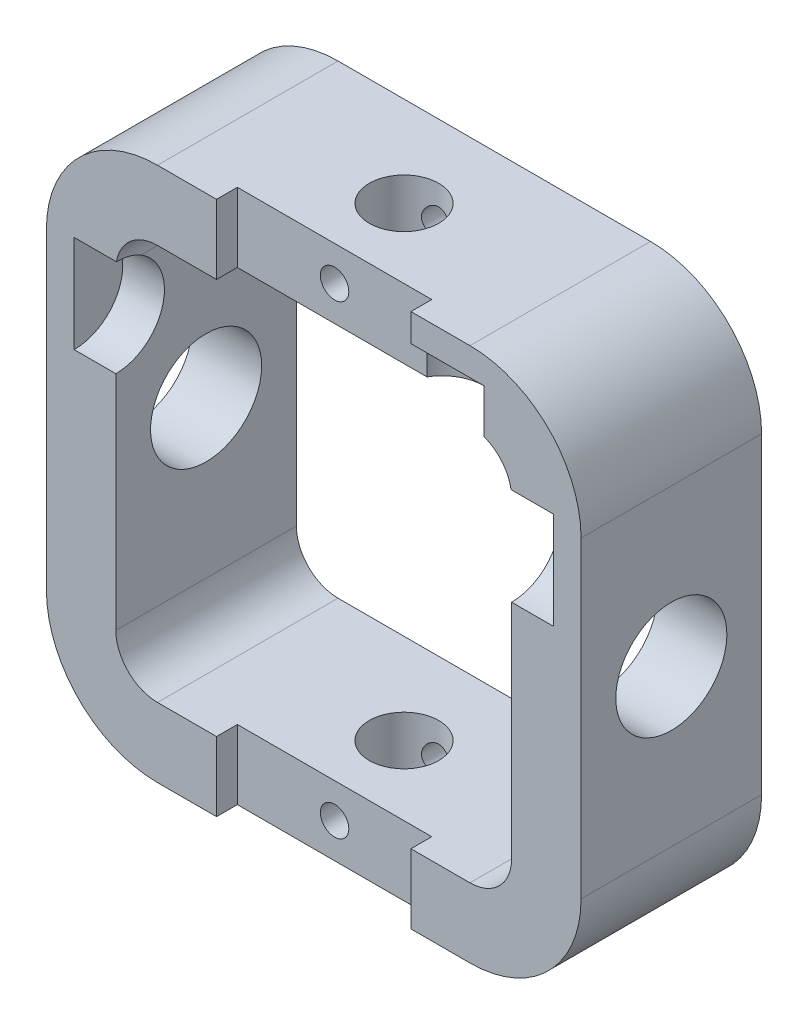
ISO-10303-21;
HEADER;
FILE_DESCRIPTION(('STEP AP214'),'2;1');
FILE_NAME('part.step','',(''),(''),'','','');
FILE_SCHEMA(('AUTOMOTIVE_DESIGN { 1 0 10303 214 1 1 1 1 }'));
ENDSEC;
DATA;
#1=APPLICATION_CONTEXT('core data for automotive mechanical design processes');
#2=APPLICATION_PROTOCOL_DEFINITION('international standard','automotive_design',2000,#1);
#3=PRODUCT_CONTEXT('',#1,'mechanical');
#4=PRODUCT('Part','Part','',(#3));
#5=PRODUCT_RELATED_PRODUCT_CATEGORY('part','',(#4));
#6=PRODUCT_DEFINITION_FORMATION('','',#4);
#7=PRODUCT_DEFINITION_CONTEXT('part definition',#1,'design');
#8=PRODUCT_DEFINITION('design','',#6,#7);
#9=PRODUCT_DEFINITION_SHAPE('','',#8);
#10=(LENGTH_UNIT() NAMED_UNIT(*) SI_UNIT(.MILLI.,.METRE.));
#11=(NAMED_UNIT(*) PLANE_ANGLE_UNIT() SI_UNIT($,.RADIAN.));
#12=(NAMED_UNIT(*) SI_UNIT($,.STERADIAN.) SOLID_ANGLE_UNIT());
#13=UNCERTAINTY_MEASURE_WITH_UNIT(LENGTH_MEASURE(1.E-05),#10,'distance_accuracy_value','');
#14=(GEOMETRIC_REPRESENTATION_CONTEXT(3) GLOBAL_UNCERTAINTY_ASSIGNED_CONTEXT((#13)) GLOBAL_UNIT_ASSIGNED_CONTEXT((#10,
#11,#12)) REPRESENTATION_CONTEXT('',''));
#15=CARTESIAN_POINT('',(0.,0.,0.));
#16=DIRECTION('',(0.,0.,1.));
#17=DIRECTION('',(1.,0.,0.));
#18=AXIS2_PLACEMENT_3D('',#15,#16,#17);
#19=CARTESIAN_POINT('',(6.64926396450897,16.5440713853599,13.));
#20=DIRECTION('',(0.,0.,-1.));
#21=DIRECTION('',(-1.,0.,0.));
#22=AXIS2_PLACEMENT_3D('',#19,#20,#21);
#23=PLANE('',#22);
#24=DIRECTION('',(0.,1.,0.));
#25=VECTOR('',#24,1.);
#26=CARTESIAN_POINT('',(7.64926396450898,-13.9569286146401,13.));
#27=LINE('',#26,#25);
#28=CARTESIAN_POINT('',(7.64926396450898,22.5440713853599,13.));
#29=VERTEX_POINT('',#28);
#30=CARTESIAN_POINT('',(7.64926396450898,19.3724985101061,13.));
#31=VERTEX_POINT('',#30);
#32=EDGE_CURVE('E229',#29,#31,#27,.F.);
#33=ORIENTED_EDGE('',*,*,#32,.T.);
#34=CARTESIAN_POINT('',(6.64926396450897,16.5440713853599,13.));
#35=DIRECTION('',(0.,0.,1.));
#36=DIRECTION('',(-1.,0.,0.));
#37=AXIS2_PLACEMENT_3D('',#34,#35,#36);
#38=CIRCLE('',#37,3.);
#39=CARTESIAN_POINT('',(9.60730385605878,17.0440713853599,13.));
#40=VERTEX_POINT('',#39);
#41=EDGE_CURVE('E240',#40,#31,#38,.T.);
#42=ORIENTED_EDGE('',*,*,#41,.F.);
#43=DIRECTION('',(1.,0.,0.));
#44=VECTOR('',#43,1.);
#45=CARTESIAN_POINT('',(-21.850736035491,17.0440713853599,13.));
#46=LINE('',#45,#44);
#47=CARTESIAN_POINT('',(12.649263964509,17.0440713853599,13.));
#48=VERTEX_POINT('',#47);
#49=EDGE_CURVE('E592',#40,#48,#46,.T.);
#50=ORIENTED_EDGE('',*,*,#49,.T.);
#51=DIRECTION('',(0.,-1.,0.));
#52=VECTOR('',#51,1.);
#53=CARTESIAN_POINT('',(12.649263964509,16.5440713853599,13.));
#54=LINE('',#53,#52);
#55=CARTESIAN_POINT('',(12.649263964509,10.0440713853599,13.));
#56=VERTEX_POINT('',#55);
#57=EDGE_CURVE('E415',#48,#56,#54,.T.);
#58=ORIENTED_EDGE('',*,*,#57,.T.);
#59=DIRECTION('',(1.,0.,0.));
#60=VECTOR('',#59,1.);
#61=CARTESIAN_POINT('',(-21.850736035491,10.0440713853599,13.));
#62=LINE('',#61,#60);
#63=CARTESIAN_POINT('',(9.64926396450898,10.0440713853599,13.));
#64=VERTEX_POINT('',#63);
#65=EDGE_CURVE('E588',#56,#64,#62,.F.);
#66=ORIENTED_EDGE('',*,*,#65,.T.);
#67=DIRECTION('',(0.,1.,0.));
#68=VECTOR('',#67,1.);
#69=CARTESIAN_POINT('',(9.64926396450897,16.5440713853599,13.));
#70=LINE('',#69,#68);
#71=CARTESIAN_POINT('',(9.64926396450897,-5.95592861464,13.));
#72=VERTEX_POINT('',#71);
#73=EDGE_CURVE('E249',#72,#64,#70,.T.);
#74=ORIENTED_EDGE('',*,*,#73,.F.);
#75=CARTESIAN_POINT('',(6.64926396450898,-5.95592861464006,13.));
#76=DIRECTION('',(0.,0.,1.));
#77=DIRECTION('',(1.,0.,0.));
#78=AXIS2_PLACEMENT_3D('',#75,#76,#77);
#79=CIRCLE('',#78,2.99999999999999);
#80=CARTESIAN_POINT('',(6.64926396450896,-8.95592861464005,13.));
#81=VERTEX_POINT('',#80);
#82=EDGE_CURVE('E254',#81,#72,#79,.T.);
#83=ORIENTED_EDGE('',*,*,#82,.F.);
#84=DIRECTION('',(1.,0.,0.));
#85=VECTOR('',#84,1.);
#86=CARTESIAN_POINT('',(-15.850736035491,-8.95592861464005,13.));
#87=LINE('',#86,#85);
#88=CARTESIAN_POINT('',(2.39926396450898,-8.95592861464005,13.));
#89=VERTEX_POINT('',#88);
#90=EDGE_CURVE('E571',#89,#81,#87,.T.);
#91=ORIENTED_EDGE('',*,*,#90,.F.);
#92=DIRECTION('',(0.,1.,0.));
#93=VECTOR('',#92,1.);
#94=CARTESIAN_POINT('',(2.39926396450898,26.4500504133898,13.));
#95=LINE('',#94,#93);
#96=CARTESIAN_POINT('',(2.39926396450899,-13.9559286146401,13.));
#97=VERTEX_POINT('',#96);
#98=EDGE_CURVE('E505',#97,#89,#95,.T.);
#99=ORIENTED_EDGE('',*,*,#98,.F.);
#100=DIRECTION('',(1.,0.,0.));
#101=VECTOR('',#100,1.);
#102=CARTESIAN_POINT('',(-15.850736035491,-13.9559286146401,13.));
#103=LINE('',#102,#101);
#104=CARTESIAN_POINT('',(6.64926396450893,-13.9559286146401,13.));
#105=VERTEX_POINT('',#104);
#106=EDGE_CURVE('E304',#97,#105,#103,.T.);
#107=ORIENTED_EDGE('',*,*,#106,.T.);
#108=CARTESIAN_POINT('',(6.64926396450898,-5.95592861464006,13.));
#109=DIRECTION('',(0.,0.,1.));
#110=DIRECTION('',(1.,0.,0.));
#111=AXIS2_PLACEMENT_3D('',#108,#109,#110);
#112=CIRCLE('',#111,8.);
#113=CARTESIAN_POINT('',(14.649263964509,-5.95592861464,13.));
#114=VERTEX_POINT('',#113);
#115=EDGE_CURVE('E308',#105,#114,#112,.T.);
#116=ORIENTED_EDGE('',*,*,#115,.T.);
#117=DIRECTION('',(0.,1.,0.));
#118=VECTOR('',#117,1.);
#119=CARTESIAN_POINT('',(14.649263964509,16.5440713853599,13.));
#120=LINE('',#119,#118);
#121=CARTESIAN_POINT('',(14.649263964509,16.5440713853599,13.));
#122=VERTEX_POINT('',#121);
#123=EDGE_CURVE('E310',#114,#122,#120,.T.);
#124=ORIENTED_EDGE('',*,*,#123,.T.);
#125=CARTESIAN_POINT('',(6.64926396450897,16.5440713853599,13.));
#126=DIRECTION('',(0.,0.,1.));
#127=DIRECTION('',(-1.,0.,0.));
#128=AXIS2_PLACEMENT_3D('',#125,#126,#127);
#129=CIRCLE('',#128,8.);
#130=CARTESIAN_POINT('',(6.64926396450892,24.5440713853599,13.));
#131=VERTEX_POINT('',#130);
#132=EDGE_CURVE('E291',#122,#131,#129,.T.);
#133=ORIENTED_EDGE('',*,*,#132,.T.);
#134=DIRECTION('',(-1.,0.,0.));
#135=VECTOR('',#134,1.);
#136=CARTESIAN_POINT('',(-15.850736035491,24.5440713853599,13.));
#137=LINE('',#136,#135);
#138=CARTESIAN_POINT('',(2.39926396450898,24.5440713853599,13.));
#139=VERTEX_POINT('',#138);
#140=EDGE_CURVE('E295',#131,#139,#137,.T.);
#141=ORIENTED_EDGE('',*,*,#140,.T.);
#142=CARTESIAN_POINT('',(2.39926396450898,22.5440713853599,13.));
#143=VERTEX_POINT('',#142);
#144=EDGE_CURVE('E502',#143,#139,#95,.T.);
#145=ORIENTED_EDGE('',*,*,#144,.F.);
#146=DIRECTION('',(-1.,0.,0.));
#147=VECTOR('',#146,1.);
#148=CARTESIAN_POINT('',(6.64926396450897,22.5440713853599,13.));
#149=LINE('',#148,#147);
#150=EDGE_CURVE('E42',#29,#143,#149,.T.);
#151=ORIENTED_EDGE('',*,*,#150,.F.);
#152=EDGE_LOOP('',(#33,#42,#50,#58,#66,#74,#83,#91,#99,#107,#116,#124,#133,#141,#145,#151));
#153=FACE_BOUND('',#152,.T.);
#154=ADVANCED_FACE('F27',(#153),#23,.F.);
#155=CARTESIAN_POINT('',(6.64926396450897,16.5440713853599,13.));
#156=DIRECTION('',(0.,0.,-1.));
#157=DIRECTION('',(-1.,0.,0.));
#158=AXIS2_PLACEMENT_3D('',#155,#156,#157);
#159=CYLINDRICAL_SURFACE('',#158,3.);
#160=ORIENTED_EDGE('',*,*,#41,.T.);
#161=CARTESIAN_POINT('',(6.64926396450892,19.5440713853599,10.7639320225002));
#162=CARTESIAN_POINT('',(6.71115343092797,19.5440709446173,10.8192732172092));
#163=CARTESIAN_POINT('',(6.77070068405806,19.5421566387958,10.8771716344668));
#164=CARTESIAN_POINT('',(6.88468135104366,19.5353646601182,10.9975620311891));
#165=CARTESIAN_POINT('',(6.93911868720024,19.530489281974,11.0600504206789));
#166=CARTESIAN_POINT('',(7.0425489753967,19.5186366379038,11.1891893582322));
#167=CARTESIAN_POINT('',(7.09154172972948,19.5116592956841,11.255840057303));
#168=CARTESIAN_POINT('',(7.18380153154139,19.4964354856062,11.3928454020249));
#169=CARTESIAN_POINT('',(7.22706759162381,19.4881887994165,11.4632006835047));
#170=CARTESIAN_POINT('',(7.3477487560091,19.4627850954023,11.6789156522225));
#171=CARTESIAN_POINT('',(7.41631808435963,19.444925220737,11.8292642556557));
#172=CARTESIAN_POINT('',(7.52785011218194,19.4131281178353,12.139296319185));
#173=CARTESIAN_POINT('',(7.57085942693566,19.3991837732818,12.2989621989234));
#174=CARTESIAN_POINT('',(7.61668773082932,19.3838543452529,12.549946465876));
#175=CARTESIAN_POINT('',(7.62888707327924,19.379641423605,12.6394592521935));
#176=CARTESIAN_POINT('',(7.64517907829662,19.3739447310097,12.819298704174));
#177=CARTESIAN_POINT('',(7.64927218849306,19.3724608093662,12.9096253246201));
#178=CARTESIAN_POINT('',(7.64926396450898,19.3724985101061,13.));
#179=B_SPLINE_CURVE_WITH_KNOTS('',3,(#161,#162,#163,#164,#165,#166,#167,#168,#169,#170,#171,
#172,#173,#174,#175,#176,#177,#178),.UNSPECIFIED.,.F.,.F.,(4,2,2,2,2,2,2,2,4),(0.,
0.248917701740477,0.497642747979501,0.746376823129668,0.995153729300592,1.49141381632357,
1.98676604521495,2.25770982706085,2.52863864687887),.UNSPECIFIED.);
#180=CARTESIAN_POINT('',(6.64926396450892,19.5440713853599,10.7639320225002));
#181=VERTEX_POINT('',#180);
#182=EDGE_CURVE('E225',#181,#31,#179,.T.);
#183=ORIENTED_EDGE('',*,*,#182,.F.);
#184=DIRECTION('',(0.,0.,-1.));
#185=VECTOR('',#184,1.);
#186=CARTESIAN_POINT('',(6.64926396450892,19.5440713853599,13.));
#187=LINE('',#186,#185);
#188=CARTESIAN_POINT('',(6.64926396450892,19.5440713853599,0.));
#189=VERTEX_POINT('',#188);
#190=EDGE_CURVE('E260',#181,#189,#187,.T.);
#191=ORIENTED_EDGE('',*,*,#190,.T.);
#192=CARTESIAN_POINT('',(6.64926396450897,16.5440713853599,0.));
#193=DIRECTION('',(0.,0.,1.));
#194=DIRECTION('',(-1.,0.,0.));
#195=AXIS2_PLACEMENT_3D('',#192,#193,#194);
#196=CIRCLE('',#195,3.);
#197=CARTESIAN_POINT('',(9.64926396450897,16.5440713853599,0.));
#198=VERTEX_POINT('',#197);
#199=EDGE_CURVE('E558',#198,#189,#196,.T.);
#200=ORIENTED_EDGE('',*,*,#199,.F.);
#201=DIRECTION('',(0.,0.,-1.));
#202=VECTOR('',#201,1.);
#203=CARTESIAN_POINT('',(9.64926396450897,16.5440713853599,13.));
#204=LINE('',#203,#202);
#205=CARTESIAN_POINT('',(9.64926396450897,16.5440713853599,11.197224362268));
#206=VERTEX_POINT('',#205);
#207=EDGE_CURVE('E262',#206,#198,#204,.T.);
#208=ORIENTED_EDGE('',*,*,#207,.F.);
#209=CARTESIAN_POINT('',(9.60730385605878,17.0440713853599,13.));
#210=CARTESIAN_POINT('',(9.60726303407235,17.0440827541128,12.9007351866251));
#211=CARTESIAN_POINT('',(9.60801647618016,17.0398488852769,12.801476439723));
#212=CARTESIAN_POINT('',(9.61081534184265,17.0229742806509,12.6036846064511));
#213=CARTESIAN_POINT('',(9.61286088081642,17.0103327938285,12.5051515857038));
#214=CARTESIAN_POINT('',(9.61789088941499,16.9770992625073,12.3117119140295));
#215=CARTESIAN_POINT('',(9.62085352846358,16.9566897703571,12.2167733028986));
#216=CARTESIAN_POINT('',(9.62720045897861,16.908073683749,12.0289712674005));
#217=CARTESIAN_POINT('',(9.63058461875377,16.8798695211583,11.9361072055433));
#218=CARTESIAN_POINT('',(9.63782753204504,16.8087186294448,11.732674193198));
#219=CARTESIAN_POINT('',(9.641624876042,16.7638890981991,11.6227511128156));
#220=CARTESIAN_POINT('',(9.64591212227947,16.6881135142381,11.4609685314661));
#221=CARTESIAN_POINT('',(9.64710969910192,16.6612154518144,11.4071950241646));
#222=CARTESIAN_POINT('',(9.64878462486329,16.6046808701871,11.3010940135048));
#223=CARTESIAN_POINT('',(9.64926194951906,16.5750442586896,11.2487665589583));
#224=CARTESIAN_POINT('',(9.64926396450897,16.5440713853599,11.197224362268));
#225=B_SPLINE_CURVE_WITH_KNOTS('',3,(#209,#210,#211,#212,#213,#214,#215,#216,#217,#218,#219,
#220,#221,#222,#223,#224),.UNSPECIFIED.,.F.,.F.,(4,2,2,2,2,2,2,4),(0.,0.297691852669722,
0.595410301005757,0.886525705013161,1.1775503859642,1.53317812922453,1.71351925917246,
1.89386646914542),.UNSPECIFIED.);
#226=EDGE_CURVE('E247',#40,#206,#225,.T.);
#227=ORIENTED_EDGE('',*,*,#226,.F.);
#228=EDGE_LOOP('',(#160,#183,#191,#200,#208,#227));
#229=FACE_BOUND('',#228,.T.);
#230=ADVANCED_FACE('F245',(#229),#159,.F.);
#231=CARTESIAN_POINT('',(-15.850736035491,19.5440713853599,13.));
#232=DIRECTION('',(0.,-1.,0.));
#233=DIRECTION('',(0.,0.,-1.));
#234=AXIS2_PLACEMENT_3D('',#231,#232,#233);
#235=PLANE('',#234);
#236=CARTESIAN_POINT('',(-4.60073603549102,19.5440713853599,6.5));
#237=DIRECTION('',(0.,-1.,0.));
#238=DIRECTION('',(0.,0.,-1.));
#239=AXIS2_PLACEMENT_3D('',#236,#237,#238);
#240=CIRCLE('',#239,2.5);
#241=CARTESIAN_POINT('',(-4.60073603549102,19.5440713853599,4.));
#242=VERTEX_POINT('',#241);
#243=EDGE_CURVE('E810',#242,#242,#240,.T.);
#244=ORIENTED_EDGE('',*,*,#243,.F.);
#245=EDGE_LOOP('',(#244));
#246=FACE_BOUND('',#245,.T.);
#247=ORIENTED_EDGE('',*,*,#190,.F.);
#248=CARTESIAN_POINT('',(4.64926396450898,19.5440713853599,13.));
#249=DIRECTION('',(0.,-1.,0.));
#250=DIRECTION('',(0.,0.,-1.));
#251=AXIS2_PLACEMENT_3D('',#248,#249,#250);
#252=CIRCLE('',#251,3.);
#253=CARTESIAN_POINT('',(2.05118775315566,19.5440713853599,11.5));
#254=VERTEX_POINT('',#253);
#255=EDGE_CURVE('E231',#254,#181,#252,.T.);
#256=ORIENTED_EDGE('',*,*,#255,.F.);
#257=DIRECTION('',(-1.,0.,0.));
#258=VECTOR('',#257,1.);
#259=CARTESIAN_POINT('',(-15.850736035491,19.5440713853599,11.5));
#260=LINE('',#259,#258);
#261=CARTESIAN_POINT('',(-11.600736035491,19.5440713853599,11.5));
#262=VERTEX_POINT('',#261);
#263=EDGE_CURVE('E336',#254,#262,#260,.T.);
#264=ORIENTED_EDGE('',*,*,#263,.T.);
#265=DIRECTION('',(0.,0.,-1.));
#266=VECTOR('',#265,1.);
#267=CARTESIAN_POINT('',(-11.600736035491,19.5440713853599,13.));
#268=LINE('',#267,#266);
#269=CARTESIAN_POINT('',(-11.600736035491,19.5440713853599,13.));
#270=VERTEX_POINT('',#269);
#271=EDGE_CURVE('E338',#270,#262,#268,.T.);
#272=ORIENTED_EDGE('',*,*,#271,.F.);
#273=DIRECTION('',(-1.,0.,0.));
#274=VECTOR('',#273,1.);
#275=CARTESIAN_POINT('',(-15.850736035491,19.5440713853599,13.));
#276=LINE('',#275,#274);
#277=CARTESIAN_POINT('',(-15.850736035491,19.5440713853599,13.));
#278=VERTEX_POINT('',#277);
#279=EDGE_CURVE('E248',#270,#278,#276,.T.);
#280=ORIENTED_EDGE('',*,*,#279,.T.);
#281=DIRECTION('',(0.,0.,-1.));
#282=VECTOR('',#281,1.);
#283=CARTESIAN_POINT('',(-15.850736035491,19.5440713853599,13.));
#284=LINE('',#283,#282);
#285=CARTESIAN_POINT('',(-15.850736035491,19.5440713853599,0.));
#286=VERTEX_POINT('',#285);
#287=EDGE_CURVE('E251',#278,#286,#284,.T.);
#288=ORIENTED_EDGE('',*,*,#287,.T.);
#289=DIRECTION('',(-1.,0.,0.));
#290=VECTOR('',#289,1.);
#291=CARTESIAN_POINT('',(-15.850736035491,19.5440713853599,0.));
#292=LINE('',#291,#290);
#293=EDGE_CURVE('E561',#189,#286,#292,.T.);
#294=ORIENTED_EDGE('',*,*,#293,.F.);
#295=EDGE_LOOP('',(#247,#256,#264,#272,#280,#288,#294));
#296=FACE_BOUND('',#295,.T.);
#297=ADVANCED_FACE('F391',(#246,#296),#235,.T.);
#298=CARTESIAN_POINT('',(-11.600736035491,-15.7842710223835,11.5));
#299=DIRECTION('',(0.,0.,1.));
#300=DIRECTION('',(1.,0.,0.));
#301=AXIS2_PLACEMENT_3D('',#298,#299,#300);
#302=PLANE('',#301);
#303=CARTESIAN_POINT('',(-4.60073603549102,22.0440713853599,11.5));
#304=DIRECTION('',(0.,0.,1.));
#305=DIRECTION('',(1.,0.,0.));
#306=AXIS2_PLACEMENT_3D('',#303,#304,#305);
#307=CIRCLE('',#306,1.02499999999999);
#308=CARTESIAN_POINT('',(-3.57573603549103,22.0440713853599,11.5));
#309=VERTEX_POINT('',#308);
#310=EDGE_CURVE('E803',#309,#309,#307,.T.);
#311=ORIENTED_EDGE('',*,*,#310,.F.);
#312=EDGE_LOOP('',(#311));
#313=FACE_BOUND('',#312,.T.);
#314=ORIENTED_EDGE('',*,*,#263,.F.);
#315=DIRECTION('',(0.,1.,0.));
#316=VECTOR('',#315,1.);
#317=CARTESIAN_POINT('',(2.05118775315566,-13.9569286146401,11.5));
#318=LINE('',#317,#316);
#319=CARTESIAN_POINT('',(2.05118775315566,22.5440713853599,11.5));
#320=VERTEX_POINT('',#319);
#321=EDGE_CURVE('E11',#254,#320,#318,.T.);
#322=ORIENTED_EDGE('',*,*,#321,.T.);
#323=DIRECTION('',(1.,0.,0.));
#324=VECTOR('',#323,1.);
#325=CARTESIAN_POINT('',(-11.600736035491,22.5440713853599,11.5));
#326=LINE('',#325,#324);
#327=CARTESIAN_POINT('',(2.39926396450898,22.5440713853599,11.5));
#328=VERTEX_POINT('',#327);
#329=EDGE_CURVE('E242',#320,#328,#326,.T.);
#330=ORIENTED_EDGE('',*,*,#329,.T.);
#331=DIRECTION('',(0.,1.,0.));
#332=VECTOR('',#331,1.);
#333=CARTESIAN_POINT('',(2.39926396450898,26.4500504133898,11.5));
#334=LINE('',#333,#332);
#335=CARTESIAN_POINT('',(2.39926396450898,24.5440713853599,11.5));
#336=VERTEX_POINT('',#335);
#337=EDGE_CURVE('E515',#328,#336,#334,.T.);
#338=ORIENTED_EDGE('',*,*,#337,.T.);
#339=DIRECTION('',(-1.,0.,0.));
#340=VECTOR('',#339,1.);
#341=CARTESIAN_POINT('',(-15.850736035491,24.5440713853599,11.5));
#342=LINE('',#341,#340);
#343=CARTESIAN_POINT('',(-11.600736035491,24.5440713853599,11.5));
#344=VERTEX_POINT('',#343);
#345=EDGE_CURVE('E523',#336,#344,#342,.T.);
#346=ORIENTED_EDGE('',*,*,#345,.T.);
#347=DIRECTION('',(0.,-1.,0.));
#348=VECTOR('',#347,1.);
#349=CARTESIAN_POINT('',(-11.600736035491,26.4500504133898,11.5));
#350=LINE('',#349,#348);
#351=EDGE_CURVE('E514',#344,#262,#350,.T.);
#352=ORIENTED_EDGE('',*,*,#351,.T.);
#353=EDGE_LOOP('',(#314,#322,#330,#338,#346,#352));
#354=FACE_BOUND('',#353,.T.);
#355=ADVANCED_FACE('F386',(#313,#354),#302,.T.);
#356=CARTESIAN_POINT('',(2.39926396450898,26.4500504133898,11.5));
#357=DIRECTION('',(1.,0.,0.));
#358=DIRECTION('',(0.,1.,0.));
#359=AXIS2_PLACEMENT_3D('',#356,#357,#358);
#360=PLANE('',#359);
#361=DIRECTION('',(0.,0.,-1.));
#362=VECTOR('',#361,1.);
#363=CARTESIAN_POINT('',(2.39926396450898,22.5440713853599,11.5));
#364=LINE('',#363,#362);
#365=EDGE_CURVE('E35',#143,#328,#364,.T.);
#366=ORIENTED_EDGE('',*,*,#365,.F.);
#367=ORIENTED_EDGE('',*,*,#144,.T.);
#368=DIRECTION('',(0.,0.,1.));
#369=VECTOR('',#368,1.);
#370=CARTESIAN_POINT('',(2.39926396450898,24.5440713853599,13.));
#371=LINE('',#370,#369);
#372=EDGE_CURVE('E531',#336,#139,#371,.T.);
#373=ORIENTED_EDGE('',*,*,#372,.F.);
#374=ORIENTED_EDGE('',*,*,#337,.F.);
#375=EDGE_LOOP('',(#366,#367,#373,#374));
#376=FACE_BOUND('',#375,.T.);
#377=ADVANCED_FACE('F390',(#376),#360,.F.);
#378=CARTESIAN_POINT('',(-4.60073603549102,-11.4559286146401,11.5));
#379=DIRECTION('',(0.,0.,1.));
#380=DIRECTION('',(1.,0.,0.));
#381=AXIS2_PLACEMENT_3D('',#378,#379,#380);
#382=CYLINDRICAL_SURFACE('',#381,1.02499999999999);
#383=CARTESIAN_POINT('',(-3.57573603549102,-11.4559286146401,4.21978619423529));
#384=CARTESIAN_POINT('',(-3.57574175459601,-11.4011688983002,4.21978073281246));
#385=CARTESIAN_POINT('',(-3.58015203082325,-11.3463162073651,4.21778494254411));
#386=CARTESIAN_POINT('',(-3.59762529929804,-11.2381885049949,4.21005369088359));
#387=CARTESIAN_POINT('',(-3.61071212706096,-11.184918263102,4.20430792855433));
#388=CARTESIAN_POINT('',(-3.64494833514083,-11.0817124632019,4.18984608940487));
#389=CARTESIAN_POINT('',(-3.66606555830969,-11.0317645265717,4.18114187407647));
#390=CARTESIAN_POINT('',(-3.71566897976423,-10.9361354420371,4.16176082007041));
#391=CARTESIAN_POINT('',(-3.7441532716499,-10.8904531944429,4.15108449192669));
#392=CARTESIAN_POINT('',(-3.80951638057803,-10.8018731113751,4.12824285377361));
#393=CARTESIAN_POINT('',(-3.84676855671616,-10.759263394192,4.11602807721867));
#394=CARTESIAN_POINT('',(-3.92782543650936,-10.6806838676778,4.09189315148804));
#395=CARTESIAN_POINT('',(-3.97163260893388,-10.6447165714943,4.07997311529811));
#396=CARTESIAN_POINT('',(-4.06680313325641,-10.5789902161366,4.05717276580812));
#397=CARTESIAN_POINT('',(-4.11840564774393,-10.5495531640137,4.04635666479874));
#398=CARTESIAN_POINT('',(-4.22635343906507,-10.4999016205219,4.02758579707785));
#399=CARTESIAN_POINT('',(-4.2826966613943,-10.4796831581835,4.01962979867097));
#400=CARTESIAN_POINT('',(-4.39550368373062,-10.4500802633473,4.00782604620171));
#401=CARTESIAN_POINT('',(-4.45181724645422,-10.4401995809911,4.00379085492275));
#402=CARTESIAN_POINT('',(-4.56543796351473,-10.4299514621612,3.99960388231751));
#403=CARTESIAN_POINT('',(-4.62274471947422,-10.4295802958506,3.99945057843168));
#404=CARTESIAN_POINT('',(-4.73312533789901,-10.4380968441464,4.00293280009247));
#405=CARTESIAN_POINT('',(-4.78624955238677,-10.4464399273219,4.00634546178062));
#406=CARTESIAN_POINT('',(-4.89026670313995,-10.4712174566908,4.01627239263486));
#407=CARTESIAN_POINT('',(-4.94115947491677,-10.4876524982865,4.02278689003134));
#408=CARTESIAN_POINT('',(-5.04019693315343,-10.5283457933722,4.03840950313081));
#409=CARTESIAN_POINT('',(-5.08828809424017,-10.5527191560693,4.0475555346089));
#410=CARTESIAN_POINT('',(-5.17982313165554,-10.608486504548,4.06754109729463));
#411=CARTESIAN_POINT('',(-5.22326537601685,-10.6398829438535,4.07838121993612));
#412=CARTESIAN_POINT('',(-5.30743263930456,-10.7113104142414,4.10153923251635));
#413=CARTESIAN_POINT('',(-5.34776725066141,-10.7517858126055,4.11390748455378));
#414=CARTESIAN_POINT('',(-5.42124145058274,-10.8389624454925,4.13816360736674));
#415=CARTESIAN_POINT('',(-5.45437843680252,-10.8856659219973,4.15005130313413));
#416=CARTESIAN_POINT('',(-5.51347417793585,-10.9858054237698,4.17235306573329));
#417=CARTESIAN_POINT('',(-5.5391789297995,-11.0394051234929,4.18271011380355));
#418=CARTESIAN_POINT('',(-5.58103971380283,-11.150710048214,4.2001033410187));
#419=CARTESIAN_POINT('',(-5.59720232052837,-11.2084124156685,4.20714180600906));
#420=CARTESIAN_POINT('',(-5.61854463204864,-11.3223791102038,4.21653902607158));
#421=CARTESIAN_POINT('',(-5.62435555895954,-11.3785027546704,4.21916612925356));
#422=CARTESIAN_POINT('',(-5.62667836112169,-11.4909725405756,4.22020932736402));
#423=CARTESIAN_POINT('',(-5.62319328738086,-11.5473186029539,4.21862680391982));
#424=CARTESIAN_POINT('',(-5.60759855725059,-11.65500820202,4.21170557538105));
#425=CARTESIAN_POINT('',(-5.59602907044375,-11.7064470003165,4.20660236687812));
#426=CARTESIAN_POINT('',(-5.56530361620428,-11.806614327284,4.19351215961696));
#427=CARTESIAN_POINT('',(-5.54614591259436,-11.8553422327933,4.18552450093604));
#428=CARTESIAN_POINT('',(-5.49990006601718,-11.9509711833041,4.16715929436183));
#429=CARTESIAN_POINT('',(-5.47251479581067,-11.9977115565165,4.15669604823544));
#430=CARTESIAN_POINT('',(-5.41089004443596,-12.0861534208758,4.13468396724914));
#431=CARTESIAN_POINT('',(-5.37664766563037,-12.1278527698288,4.123134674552));
#432=CARTESIAN_POINT('',(-5.29911687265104,-12.2084268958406,4.09915974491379));
#433=CARTESIAN_POINT('',(-5.25532995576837,-12.2468245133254,4.08673633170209));
#434=CARTESIAN_POINT('',(-5.16164249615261,-12.315807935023,4.06325760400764));
#435=CARTESIAN_POINT('',(-5.11174158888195,-12.3463932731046,4.05220237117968));
#436=CARTESIAN_POINT('',(-5.00696457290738,-12.3988165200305,4.03264945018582));
#437=CARTESIAN_POINT('',(-4.95208172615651,-12.4206423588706,4.02415529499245));
#438=CARTESIAN_POINT('',(-4.83898711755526,-12.4545985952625,4.01072882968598));
#439=CARTESIAN_POINT('',(-4.78077728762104,-12.466734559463,4.00579447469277));
#440=CARTESIAN_POINT('',(-4.66695380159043,-12.4802817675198,4.00027198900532));
#441=CARTESIAN_POINT('',(-4.61143297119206,-12.4823665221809,3.99941099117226));
#442=CARTESIAN_POINT('',(-4.50085558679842,-12.477549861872,4.0013844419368));
#443=CARTESIAN_POINT('',(-4.44579895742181,-12.470649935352,4.00421827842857));
#444=CARTESIAN_POINT('',(-4.33961107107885,-12.4485427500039,4.01312225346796));
#445=CARTESIAN_POINT('',(-4.28841009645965,-12.4336217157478,4.01908072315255));
#446=CARTESIAN_POINT('',(-4.18925316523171,-12.3962033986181,4.0335865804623));
#447=CARTESIAN_POINT('',(-4.14129783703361,-12.373704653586,4.04213446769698));
#448=CARTESIAN_POINT('',(-4.04762643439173,-12.3206375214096,4.06146364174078));
#449=CARTESIAN_POINT('',(-4.00210728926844,-12.2897524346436,4.07232791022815));
#450=CARTESIAN_POINT('',(-3.91670605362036,-12.2212566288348,4.09499306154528));
#451=CARTESIAN_POINT('',(-3.87682598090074,-12.1836435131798,4.10679427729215));
#452=CARTESIAN_POINT('',(-3.80112176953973,-12.0998501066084,4.1309709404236));
#453=CARTESIAN_POINT('',(-3.7657344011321,-12.0532700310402,4.14333336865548));
#454=CARTESIAN_POINT('',(-3.70322172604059,-11.9544377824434,4.16642265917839));
#455=CARTESIAN_POINT('',(-3.67610095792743,-11.9021825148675,4.17714862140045));
#456=CARTESIAN_POINT('',(-3.63123117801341,-11.7937244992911,4.19551587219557));
#457=CARTESIAN_POINT('',(-3.61341622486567,-11.7375528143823,4.20317877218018));
#458=CARTESIAN_POINT('',(-3.58769631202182,-11.6227036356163,4.21440246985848));
#459=CARTESIAN_POINT('',(-3.57975810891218,-11.5640352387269,4.2179770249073));
#460=CARTESIAN_POINT('',(-3.57612907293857,-11.4887785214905,4.21961031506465));
#461=CARTESIAN_POINT('',(-3.5757343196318,-11.472357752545,4.21978783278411));
#462=CARTESIAN_POINT('',(-3.57573603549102,-11.4559286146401,4.21978619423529));
#463=B_SPLINE_CURVE_WITH_KNOTS('',3,(#383,#384,#385,#386,#387,#388,#389,#390,#391,#392,#393,
#394,#395,#396,#397,#398,#399,#400,#401,#402,#403,#404,#405,#406,#407,#408,#409,#410,#411,#412,
#413,#414,#415,#416,#417,#418,#419,#420,#421,#422,#423,#424,#425,#426,#427,#428,#429,#430,#431,
#432,#433,#434,#435,#436,#437,#438,#439,#440,#441,#442,#443,#444,#445,#446,#447,#448,#449,#450,
#451,#452,#453,#454,#455,#456,#457,#458,#459,#460,#461,#462),.UNSPECIFIED.,.T.,.F.,(4,2,2,2,2,2,
2,2,2,2,2,2,2,2,2,2,2,2,2,2,2,2,2,2,2,2,2,2,2,2,2,2,2,2,2,2,2,2,2,4),(0.,0.164233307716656,
0.328919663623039,0.492953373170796,0.656944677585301,0.829887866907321,1.00289635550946,
1.18313020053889,1.36328633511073,1.53433037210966,1.7053073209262,1.86620313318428,
2.02711078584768,2.19046409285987,2.35387455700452,2.52848685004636,2.70316217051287,
2.88324548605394,3.06320457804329,3.23175682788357,3.40025376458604,3.55845186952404,
3.71668619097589,3.88151241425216,4.04640843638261,4.22422183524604,4.40204584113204,
4.58011404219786,4.75807987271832,4.92393723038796,5.08976711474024,5.25003819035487,
5.41034020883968,5.57783264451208,5.74538486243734,5.92391195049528,6.10253687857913,
6.27987827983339,6.45662115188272,6.50589481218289),.UNSPECIFIED.);
#464=CARTESIAN_POINT('',(-3.57573603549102,-11.4559286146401,4.21978619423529));
#465=VERTEX_POINT('',#464);
#466=EDGE_CURVE('E374',#465,#465,#463,.T.);
#467=ORIENTED_EDGE('',*,*,#466,.T.);
#468=EDGE_LOOP('',(#467));
#469=FACE_BOUND('',#468,.T.);
#470=CARTESIAN_POINT('',(-4.60073603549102,-11.4559286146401,0.));
#471=DIRECTION('',(0.,0.,1.));
#472=DIRECTION('',(1.,0.,0.));
#473=AXIS2_PLACEMENT_3D('',#470,#471,#472);
#474=CIRCLE('',#473,1.025);
#475=CARTESIAN_POINT('',(-3.57573603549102,-11.4559286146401,0.));
#476=VERTEX_POINT('',#475);
#477=EDGE_CURVE('E807',#476,#476,#474,.T.);
#478=ORIENTED_EDGE('',*,*,#477,.F.);
#479=EDGE_LOOP('',(#478));
#480=FACE_BOUND('',#479,.T.);
#481=ADVANCED_FACE('F385',(#469,#480),#382,.F.);
#482=CARTESIAN_POINT('',(-4.60073603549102,22.0440713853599,11.5));
#483=DIRECTION('',(0.,0.,1.));
#484=DIRECTION('',(1.,0.,0.));
#485=AXIS2_PLACEMENT_3D('',#482,#483,#484);
#486=CYLINDRICAL_SURFACE('',#485,1.02499999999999);
#487=CARTESIAN_POINT('',(-3.57573603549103,22.0440713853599,4.21978619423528));
#488=CARTESIAN_POINT('',(-3.57574175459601,22.0988311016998,4.21978073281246));
#489=CARTESIAN_POINT('',(-3.58015203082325,22.1536837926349,4.21778494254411));
#490=CARTESIAN_POINT('',(-3.59762529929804,22.2618114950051,4.21005369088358));
#491=CARTESIAN_POINT('',(-3.61071212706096,22.3150817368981,4.20430792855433));
#492=CARTESIAN_POINT('',(-3.64494833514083,22.4182875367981,4.18984608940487));
#493=CARTESIAN_POINT('',(-3.6660655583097,22.4682354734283,4.18114187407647));
#494=CARTESIAN_POINT('',(-3.71566897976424,22.5638645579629,4.16176082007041));
#495=CARTESIAN_POINT('',(-3.7441532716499,22.6095468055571,4.15108449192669));
#496=CARTESIAN_POINT('',(-3.80951638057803,22.698126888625,4.12824285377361));
#497=CARTESIAN_POINT('',(-3.84676855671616,22.740736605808,4.11602807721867));
#498=CARTESIAN_POINT('',(-3.92782543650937,22.8193161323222,4.09189315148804));
#499=CARTESIAN_POINT('',(-3.97163260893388,22.8552834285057,4.07997311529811));
#500=CARTESIAN_POINT('',(-4.06680313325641,22.9210097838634,4.05717276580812));
#501=CARTESIAN_POINT('',(-4.11840564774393,22.9504468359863,4.04635666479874));
#502=CARTESIAN_POINT('',(-4.22635343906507,23.0000983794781,4.02758579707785));
#503=CARTESIAN_POINT('',(-4.2826966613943,23.0203168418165,4.01962979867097));
#504=CARTESIAN_POINT('',(-4.39550368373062,23.0499197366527,4.00782604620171));
#505=CARTESIAN_POINT('',(-4.45181724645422,23.0598004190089,4.00379085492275));
#506=CARTESIAN_POINT('',(-4.56543796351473,23.0700485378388,3.99960388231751));
#507=CARTESIAN_POINT('',(-4.62274471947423,23.0704197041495,3.99945057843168));
#508=CARTESIAN_POINT('',(-4.73312533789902,23.0619031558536,4.00293280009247));
#509=CARTESIAN_POINT('',(-4.78624955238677,23.0535600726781,4.00634546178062));
#510=CARTESIAN_POINT('',(-4.89026670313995,23.0287825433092,4.01627239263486));
#511=CARTESIAN_POINT('',(-4.94115947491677,23.0123475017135,4.02278689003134));
#512=CARTESIAN_POINT('',(-5.04019693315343,22.9716542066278,4.03840950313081));
#513=CARTESIAN_POINT('',(-5.08828809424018,22.9472808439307,4.0475555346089));
#514=CARTESIAN_POINT('',(-5.17982313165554,22.891513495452,4.06754109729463));
#515=CARTESIAN_POINT('',(-5.22326537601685,22.8601170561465,4.07838121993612));
#516=CARTESIAN_POINT('',(-5.30743263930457,22.7886895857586,4.10153923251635));
#517=CARTESIAN_POINT('',(-5.34776725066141,22.7482141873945,4.11390748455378));
#518=CARTESIAN_POINT('',(-5.42124145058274,22.6610375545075,4.13816360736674));
#519=CARTESIAN_POINT('',(-5.45437843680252,22.6143340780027,4.15005130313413));
#520=CARTESIAN_POINT('',(-5.51347417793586,22.5141945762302,4.1723530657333));
#521=CARTESIAN_POINT('',(-5.5391789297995,22.4605948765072,4.18271011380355));
#522=CARTESIAN_POINT('',(-5.58103971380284,22.349289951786,4.20010334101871));
#523=CARTESIAN_POINT('',(-5.59720232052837,22.2915875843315,4.20714180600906));
#524=CARTESIAN_POINT('',(-5.61854463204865,22.1776208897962,4.21653902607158));
#525=CARTESIAN_POINT('',(-5.62435555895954,22.1214972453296,4.21916612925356));
#526=CARTESIAN_POINT('',(-5.6266783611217,22.0090274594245,4.22020932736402));
#527=CARTESIAN_POINT('',(-5.62319328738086,21.9526813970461,4.21862680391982));
#528=CARTESIAN_POINT('',(-5.6075985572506,21.84499179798,4.21170557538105));
#529=CARTESIAN_POINT('',(-5.59602907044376,21.7935529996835,4.20660236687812));
#530=CARTESIAN_POINT('',(-5.56530361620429,21.693385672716,4.19351215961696));
#531=CARTESIAN_POINT('',(-5.54614591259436,21.6446577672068,4.18552450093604));
#532=CARTESIAN_POINT('',(-5.49990006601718,21.5490288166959,4.16715929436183));
#533=CARTESIAN_POINT('',(-5.47251479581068,21.5022884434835,4.15669604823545));
#534=CARTESIAN_POINT('',(-5.41089004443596,21.4138465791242,4.13468396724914));
#535=CARTESIAN_POINT('',(-5.37664766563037,21.3721472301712,4.12313467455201));
#536=CARTESIAN_POINT('',(-5.29911687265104,21.2915731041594,4.09915974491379));
#537=CARTESIAN_POINT('',(-5.25532995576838,21.2531754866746,4.08673633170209));
#538=CARTESIAN_POINT('',(-5.16164249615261,21.184192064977,4.06325760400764));
#539=CARTESIAN_POINT('',(-5.11174158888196,21.1536067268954,4.05220237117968));
#540=CARTESIAN_POINT('',(-5.00696457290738,21.1011834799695,4.03264945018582));
#541=CARTESIAN_POINT('',(-4.95208172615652,21.0793576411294,4.02415529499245));
#542=CARTESIAN_POINT('',(-4.83898711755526,21.0454014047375,4.01072882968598));
#543=CARTESIAN_POINT('',(-4.78077728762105,21.033265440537,4.00579447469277));
#544=CARTESIAN_POINT('',(-4.66695380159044,21.0197182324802,4.00027198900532));
#545=CARTESIAN_POINT('',(-4.61143297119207,21.0176334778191,3.99941099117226));
#546=CARTESIAN_POINT('',(-4.50085558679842,21.022450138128,4.0013844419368));
#547=CARTESIAN_POINT('',(-4.44579895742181,21.029350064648,4.00421827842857));
#548=CARTESIAN_POINT('',(-4.33961107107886,21.0514572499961,4.01312225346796));
#549=CARTESIAN_POINT('',(-4.28841009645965,21.0663782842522,4.01908072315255));
#550=CARTESIAN_POINT('',(-4.18925316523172,21.1037966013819,4.0335865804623));
#551=CARTESIAN_POINT('',(-4.14129783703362,21.126295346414,4.04213446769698));
#552=CARTESIAN_POINT('',(-4.04762643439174,21.1793624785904,4.06146364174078));
#553=CARTESIAN_POINT('',(-4.00210728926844,21.2102475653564,4.07232791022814));
#554=CARTESIAN_POINT('',(-3.91670605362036,21.2787433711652,4.09499306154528));
#555=CARTESIAN_POINT('',(-3.87682598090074,21.3163564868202,4.10679427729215));
#556=CARTESIAN_POINT('',(-3.80112176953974,21.4001498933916,4.1309709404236));
#557=CARTESIAN_POINT('',(-3.7657344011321,21.4467299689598,4.14333336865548));
#558=CARTESIAN_POINT('',(-3.70322172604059,21.5455622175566,4.16642265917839));
#559=CARTESIAN_POINT('',(-3.67610095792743,21.5978174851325,4.17714862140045));
#560=CARTESIAN_POINT('',(-3.63123117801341,21.7062755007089,4.19551587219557));
#561=CARTESIAN_POINT('',(-3.61341622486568,21.7624471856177,4.20317877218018));
#562=CARTESIAN_POINT('',(-3.58769631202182,21.8772963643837,4.21440246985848));
#563=CARTESIAN_POINT('',(-3.57975810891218,21.9359647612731,4.2179770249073));
#564=CARTESIAN_POINT('',(-3.57612907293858,22.0112214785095,4.21961031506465));
#565=CARTESIAN_POINT('',(-3.5757343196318,22.027642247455,4.21978783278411));
#566=CARTESIAN_POINT('',(-3.57573603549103,22.0440713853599,4.21978619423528));
#567=B_SPLINE_CURVE_WITH_KNOTS('',3,(#487,#488,#489,#490,#491,#492,#493,#494,#495,#496,#497,
#498,#499,#500,#501,#502,#503,#504,#505,#506,#507,#508,#509,#510,#511,#512,#513,#514,#515,#516,
#517,#518,#519,#520,#521,#522,#523,#524,#525,#526,#527,#528,#529,#530,#531,#532,#533,#534,#535,
#536,#537,#538,#539,#540,#541,#542,#543,#544,#545,#546,#547,#548,#549,#550,#551,#552,#553,#554,
#555,#556,#557,#558,#559,#560,#561,#562,#563,#564,#565,#566),.UNSPECIFIED.,.T.,.F.,(4,2,2,2,2,2,
2,2,2,2,2,2,2,2,2,2,2,2,2,2,2,2,2,2,2,2,2,2,2,2,2,2,2,2,2,2,2,2,2,4),(0.,0.164233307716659,
0.328919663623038,0.492953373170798,0.656944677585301,0.829887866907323,1.00289635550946,
1.18313020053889,1.36328633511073,1.53433037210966,1.70530732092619,1.86620313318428,
2.02711078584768,2.19046409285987,2.35387455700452,2.52848685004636,2.70316217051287,
2.88324548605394,3.06320457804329,3.23175682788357,3.40025376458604,3.55845186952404,
3.71668619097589,3.88151241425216,4.04640843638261,4.22422183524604,4.40204584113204,
4.58011404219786,4.75807987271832,4.92393723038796,5.08976711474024,5.25003819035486,
5.41034020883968,5.57783264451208,5.74538486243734,5.92391195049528,6.10253687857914,
6.27987827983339,6.45662115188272,6.50589481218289),.UNSPECIFIED.);
#568=CARTESIAN_POINT('',(-3.57573603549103,22.0440713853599,4.21978619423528));
#569=VERTEX_POINT('',#568);
#570=EDGE_CURVE('E348',#569,#569,#567,.T.);
#571=ORIENTED_EDGE('',*,*,#570,.T.);
#572=EDGE_LOOP('',(#571));
#573=FACE_BOUND('',#572,.T.);
#574=CARTESIAN_POINT('',(-4.60073603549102,22.0440713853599,0.));
#575=DIRECTION('',(0.,0.,1.));
#576=DIRECTION('',(1.,0.,0.));
#577=AXIS2_PLACEMENT_3D('',#574,#575,#576);
#578=CIRCLE('',#577,1.025);
#579=CARTESIAN_POINT('',(-3.57573603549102,22.0440713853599,0.));
#580=VERTEX_POINT('',#579);
#581=EDGE_CURVE('E801',#580,#580,#578,.T.);
#582=ORIENTED_EDGE('',*,*,#581,.F.);
#583=EDGE_LOOP('',(#582));
#584=FACE_BOUND('',#583,.T.);
#585=ADVANCED_FACE('F450',(#573,#584),#486,.F.);
#586=CARTESIAN_POINT('',(6.64926396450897,16.5440713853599,0.));
#587=DIRECTION('',(0.,0.,-1.));
#588=DIRECTION('',(-1.,0.,0.));
#589=AXIS2_PLACEMENT_3D('',#586,#587,#588);
#590=PLANE('',#589);
#591=ORIENTED_EDGE('',*,*,#477,.T.);
#592=EDGE_LOOP('',(#591));
#593=FACE_BOUND('',#592,.T.);
#594=CARTESIAN_POINT('',(6.64926396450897,16.5440713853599,0.));
#595=DIRECTION('',(0.,0.,1.));
#596=DIRECTION('',(-1.,0.,0.));
#597=AXIS2_PLACEMENT_3D('',#594,#595,#596);
#598=CIRCLE('',#597,8.);
#599=CARTESIAN_POINT('',(14.649263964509,16.5440713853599,0.));
#600=VERTEX_POINT('',#599);
#601=CARTESIAN_POINT('',(6.64926396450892,24.5440713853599,0.));
#602=VERTEX_POINT('',#601);
#603=EDGE_CURVE('E274',#600,#602,#598,.T.);
#604=ORIENTED_EDGE('',*,*,#603,.F.);
#605=DIRECTION('',(0.,1.,0.));
#606=VECTOR('',#605,1.);
#607=CARTESIAN_POINT('',(14.649263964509,16.5440713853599,0.));
#608=LINE('',#607,#606);
#609=CARTESIAN_POINT('',(14.649263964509,-5.95592861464,0.));
#610=VERTEX_POINT('',#609);
#611=EDGE_CURVE('E289',#610,#600,#608,.T.);
#612=ORIENTED_EDGE('',*,*,#611,.F.);
#613=CARTESIAN_POINT('',(6.64926396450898,-5.95592861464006,0.));
#614=DIRECTION('',(0.,0.,1.));
#615=DIRECTION('',(1.,0.,0.));
#616=AXIS2_PLACEMENT_3D('',#613,#614,#615);
#617=CIRCLE('',#616,8.);
#618=CARTESIAN_POINT('',(6.64926396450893,-13.9559286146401,0.));
#619=VERTEX_POINT('',#618);
#620=EDGE_CURVE('E287',#619,#610,#617,.T.);
#621=ORIENTED_EDGE('',*,*,#620,.F.);
#622=DIRECTION('',(1.,0.,0.));
#623=VECTOR('',#622,1.);
#624=CARTESIAN_POINT('',(-15.850736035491,-13.9559286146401,0.));
#625=LINE('',#624,#623);
#626=CARTESIAN_POINT('',(-15.850736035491,-13.9559286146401,0.));
#627=VERTEX_POINT('',#626);
#628=EDGE_CURVE('E285',#627,#619,#625,.T.);
#629=ORIENTED_EDGE('',*,*,#628,.F.);
#630=CARTESIAN_POINT('',(-15.850736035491,-5.95592861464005,0.));
#631=DIRECTION('',(0.,0.,1.));
#632=DIRECTION('',(1.,0.,0.));
#633=AXIS2_PLACEMENT_3D('',#630,#631,#632);
#634=CIRCLE('',#633,8.);
#635=CARTESIAN_POINT('',(-23.850736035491,-5.95592861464,0.));
#636=VERTEX_POINT('',#635);
#637=EDGE_CURVE('E283',#636,#627,#634,.T.);
#638=ORIENTED_EDGE('',*,*,#637,.F.);
#639=DIRECTION('',(0.,-1.,0.));
#640=VECTOR('',#639,1.);
#641=CARTESIAN_POINT('',(-23.850736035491,16.5440713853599,0.));
#642=LINE('',#641,#640);
#643=CARTESIAN_POINT('',(-23.850736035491,16.5440713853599,0.));
#644=VERTEX_POINT('',#643);
#645=EDGE_CURVE('E281',#644,#636,#642,.T.);
#646=ORIENTED_EDGE('',*,*,#645,.F.);
#647=CARTESIAN_POINT('',(-15.850736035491,16.5440713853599,0.));
#648=DIRECTION('',(0.,0.,1.));
#649=DIRECTION('',(1.,0.,0.));
#650=AXIS2_PLACEMENT_3D('',#647,#648,#649);
#651=CIRCLE('',#650,8.);
#652=CARTESIAN_POINT('',(-15.850736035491,24.5440713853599,0.));
#653=VERTEX_POINT('',#652);
#654=EDGE_CURVE('E279',#653,#644,#651,.T.);
#655=ORIENTED_EDGE('',*,*,#654,.F.);
#656=DIRECTION('',(-1.,0.,0.));
#657=VECTOR('',#656,1.);
#658=CARTESIAN_POINT('',(-15.850736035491,24.5440713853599,0.));
#659=LINE('',#658,#657);
#660=EDGE_CURVE('E277',#602,#653,#659,.T.);
#661=ORIENTED_EDGE('',*,*,#660,.F.);
#662=EDGE_LOOP('',(#604,#612,#621,#629,#638,#646,#655,#661));
#663=FACE_BOUND('',#662,.T.);
#664=ORIENTED_EDGE('',*,*,#293,.T.);
#665=CARTESIAN_POINT('',(-15.850736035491,16.5440713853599,0.));
#666=DIRECTION('',(0.,0.,1.));
#667=DIRECTION('',(1.,0.,0.));
#668=AXIS2_PLACEMENT_3D('',#665,#666,#667);
#669=CIRCLE('',#668,3.);
#670=CARTESIAN_POINT('',(-18.850736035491,16.5440713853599,0.));
#671=VERTEX_POINT('',#670);
#672=EDGE_CURVE('E540',#286,#671,#669,.T.);
#673=ORIENTED_EDGE('',*,*,#672,.T.);
#674=DIRECTION('',(0.,-1.,0.));
#675=VECTOR('',#674,1.);
#676=CARTESIAN_POINT('',(-18.850736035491,16.5440713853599,0.));
#677=LINE('',#676,#675);
#678=CARTESIAN_POINT('',(-18.850736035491,-5.95592861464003,0.));
#679=VERTEX_POINT('',#678);
#680=EDGE_CURVE('E543',#671,#679,#677,.T.);
#681=ORIENTED_EDGE('',*,*,#680,.T.);
#682=CARTESIAN_POINT('',(-15.850736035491,-5.95592861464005,0.));
#683=DIRECTION('',(0.,0.,1.));
#684=DIRECTION('',(1.,0.,0.));
#685=AXIS2_PLACEMENT_3D('',#682,#683,#684);
#686=CIRCLE('',#685,3.);
#687=CARTESIAN_POINT('',(-15.850736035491,-8.95592861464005,0.));
#688=VERTEX_POINT('',#687);
#689=EDGE_CURVE('E546',#679,#688,#686,.T.);
#690=ORIENTED_EDGE('',*,*,#689,.T.);
#691=DIRECTION('',(1.,0.,0.));
#692=VECTOR('',#691,1.);
#693=CARTESIAN_POINT('',(-15.850736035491,-8.95592861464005,0.));
#694=LINE('',#693,#692);
#695=CARTESIAN_POINT('',(6.64926396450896,-8.95592861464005,0.));
#696=VERTEX_POINT('',#695);
#697=EDGE_CURVE('E549',#688,#696,#694,.T.);
#698=ORIENTED_EDGE('',*,*,#697,.T.);
#699=CARTESIAN_POINT('',(6.64926396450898,-5.95592861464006,0.));
#700=DIRECTION('',(0.,0.,1.));
#701=DIRECTION('',(1.,0.,0.));
#702=AXIS2_PLACEMENT_3D('',#699,#700,#701);
#703=CIRCLE('',#702,2.99999999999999);
#704=CARTESIAN_POINT('',(9.64926396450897,-5.95592861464,0.));
#705=VERTEX_POINT('',#704);
#706=EDGE_CURVE('E552',#696,#705,#703,.T.);
#707=ORIENTED_EDGE('',*,*,#706,.T.);
#708=DIRECTION('',(0.,1.,0.));
#709=VECTOR('',#708,1.);
#710=CARTESIAN_POINT('',(9.64926396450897,16.5440713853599,0.));
#711=LINE('',#710,#709);
#712=EDGE_CURVE('E555',#705,#198,#711,.T.);
#713=ORIENTED_EDGE('',*,*,#712,.T.);
#714=ORIENTED_EDGE('',*,*,#199,.T.);
#715=EDGE_LOOP('',(#664,#673,#681,#690,#698,#707,#713,#714));
#716=FACE_BOUND('',#715,.T.);
#717=ORIENTED_EDGE('',*,*,#581,.T.);
#718=EDGE_LOOP('',(#717));
#719=FACE_BOUND('',#718,.T.);
#720=ADVANCED_FACE('F446',(#593,#663,#716,#719),#590,.T.);
#721=DIRECTION('',(0.,-1.,0.));
#722=VECTOR('',#721,1.);
#723=CARTESIAN_POINT('',(-21.850736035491,16.5440713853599,13.));
#724=LINE('',#723,#722);
#725=CARTESIAN_POINT('',(-21.850736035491,17.0440713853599,13.));
#726=VERTEX_POINT('',#725);
#727=CARTESIAN_POINT('',(-21.850736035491,10.0440713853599,13.));
#728=VERTEX_POINT('',#727);
#729=EDGE_CURVE('E852',#726,#728,#724,.T.);
#730=ORIENTED_EDGE('',*,*,#729,.F.);
#731=DIRECTION('',(1.,0.,0.));
#732=VECTOR('',#731,1.);
#733=CARTESIAN_POINT('',(-21.850736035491,17.0440713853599,13.));
#734=LINE('',#733,#732);
#735=CARTESIAN_POINT('',(-18.8087759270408,17.0440713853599,13.));
#736=VERTEX_POINT('',#735);
#737=EDGE_CURVE('E854',#726,#736,#734,.T.);
#738=ORIENTED_EDGE('',*,*,#737,.T.);
#739=CARTESIAN_POINT('',(-15.850736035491,16.5440713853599,13.));
#740=DIRECTION('',(0.,0.,1.));
#741=DIRECTION('',(1.,0.,0.));
#742=AXIS2_PLACEMENT_3D('',#739,#740,#741);
#743=CIRCLE('',#742,3.);
#744=EDGE_CURVE('E564',#278,#736,#743,.T.);
#745=ORIENTED_EDGE('',*,*,#744,.F.);
#746=ORIENTED_EDGE('',*,*,#279,.F.);
#747=DIRECTION('',(0.,-1.,0.));
#748=VECTOR('',#747,1.);
#749=CARTESIAN_POINT('',(-11.600736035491,26.4500504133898,13.));
#750=LINE('',#749,#748);
#751=CARTESIAN_POINT('',(-11.600736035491,24.5440713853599,13.));
#752=VERTEX_POINT('',#751);
#753=EDGE_CURVE('E499',#752,#270,#750,.T.);
#754=ORIENTED_EDGE('',*,*,#753,.F.);
#755=CARTESIAN_POINT('',(-15.850736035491,24.5440713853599,13.));
#756=VERTEX_POINT('',#755);
#757=EDGE_CURVE('E294',#752,#756,#137,.T.);
#758=ORIENTED_EDGE('',*,*,#757,.T.);
#759=CARTESIAN_POINT('',(-15.850736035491,16.5440713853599,13.));
#760=DIRECTION('',(0.,0.,1.));
#761=DIRECTION('',(1.,0.,0.));
#762=AXIS2_PLACEMENT_3D('',#759,#760,#761);
#763=CIRCLE('',#762,8.);
#764=CARTESIAN_POINT('',(-23.850736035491,16.5440713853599,13.));
#765=VERTEX_POINT('',#764);
#766=EDGE_CURVE('E298',#756,#765,#763,.T.);
#767=ORIENTED_EDGE('',*,*,#766,.T.);
#768=DIRECTION('',(0.,-1.,0.));
#769=VECTOR('',#768,1.);
#770=CARTESIAN_POINT('',(-23.850736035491,16.5440713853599,13.));
#771=LINE('',#770,#769);
#772=CARTESIAN_POINT('',(-23.850736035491,-5.95592861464,13.));
#773=VERTEX_POINT('',#772);
#774=EDGE_CURVE('E300',#765,#773,#771,.T.);
#775=ORIENTED_EDGE('',*,*,#774,.T.);
#776=CARTESIAN_POINT('',(-15.850736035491,-5.95592861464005,13.));
#777=DIRECTION('',(0.,0.,1.));
#778=DIRECTION('',(1.,0.,0.));
#779=AXIS2_PLACEMENT_3D('',#776,#777,#778);
#780=CIRCLE('',#779,8.);
#781=CARTESIAN_POINT('',(-15.850736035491,-13.9559286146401,13.));
#782=VERTEX_POINT('',#781);
#783=EDGE_CURVE('E302',#773,#782,#780,.T.);
#784=ORIENTED_EDGE('',*,*,#783,.T.);
#785=CARTESIAN_POINT('',(-11.600736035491,-13.9559286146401,13.));
#786=VERTEX_POINT('',#785);
#787=EDGE_CURVE('E305',#782,#786,#103,.T.);
#788=ORIENTED_EDGE('',*,*,#787,.T.);
#789=CARTESIAN_POINT('',(-11.600736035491,-8.95592861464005,13.));
#790=VERTEX_POINT('',#789);
#791=EDGE_CURVE('E503',#790,#786,#750,.T.);
#792=ORIENTED_EDGE('',*,*,#791,.F.);
#793=CARTESIAN_POINT('',(-15.850736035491,-8.95592861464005,13.));
#794=VERTEX_POINT('',#793);
#795=EDGE_CURVE('E572',#794,#790,#87,.T.);
#796=ORIENTED_EDGE('',*,*,#795,.F.);
#797=CARTESIAN_POINT('',(-15.850736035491,-5.95592861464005,13.));
#798=DIRECTION('',(0.,0.,1.));
#799=DIRECTION('',(1.,0.,0.));
#800=AXIS2_PLACEMENT_3D('',#797,#798,#799);
#801=CIRCLE('',#800,3.);
#802=CARTESIAN_POINT('',(-18.850736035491,-5.95592861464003,13.));
#803=VERTEX_POINT('',#802);
#804=EDGE_CURVE('E569',#803,#794,#801,.T.);
#805=ORIENTED_EDGE('',*,*,#804,.F.);
#806=DIRECTION('',(0.,-1.,0.));
#807=VECTOR('',#806,1.);
#808=CARTESIAN_POINT('',(-18.850736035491,16.5440713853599,13.));
#809=LINE('',#808,#807);
#810=CARTESIAN_POINT('',(-18.850736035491,10.0440713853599,13.));
#811=VERTEX_POINT('',#810);
#812=EDGE_CURVE('E567',#811,#803,#809,.T.);
#813=ORIENTED_EDGE('',*,*,#812,.F.);
#814=DIRECTION('',(1.,0.,0.));
#815=VECTOR('',#814,1.);
#816=CARTESIAN_POINT('',(-21.850736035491,10.0440713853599,13.));
#817=LINE('',#816,#815);
#818=EDGE_CURVE('E50',#811,#728,#817,.F.);
#819=ORIENTED_EDGE('',*,*,#818,.T.);
#820=EDGE_LOOP('',(#730,#738,#745,#746,#754,#758,#767,#775,#784,#788,#792,#796,#805,#813,#819));
#821=FACE_BOUND('',#820,.T.);
#822=ADVANCED_FACE('F449',(#821),#23,.F.);
#823=CARTESIAN_POINT('',(6.64926396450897,16.5440713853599,13.));
#824=DIRECTION('',(0.,0.,-1.));
#825=DIRECTION('',(-1.,0.,0.));
#826=AXIS2_PLACEMENT_3D('',#823,#824,#825);
#827=CYLINDRICAL_SURFACE('',#826,8.);
#828=ORIENTED_EDGE('',*,*,#603,.T.);
#829=DIRECTION('',(0.,0.,-1.));
#830=VECTOR('',#829,1.);
#831=CARTESIAN_POINT('',(6.64926396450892,24.5440713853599,13.));
#832=LINE('',#831,#830);
#833=EDGE_CURVE('E333',#131,#602,#832,.T.);
#834=ORIENTED_EDGE('',*,*,#833,.F.);
#835=ORIENTED_EDGE('',*,*,#132,.F.);
#836=DIRECTION('',(0.,0.,-1.));
#837=VECTOR('',#836,1.);
#838=CARTESIAN_POINT('',(14.649263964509,16.5440713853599,13.));
#839=LINE('',#838,#837);
#840=EDGE_CURVE('E312',#122,#600,#839,.T.);
#841=ORIENTED_EDGE('',*,*,#840,.T.);
#842=EDGE_LOOP('',(#828,#834,#835,#841));
#843=FACE_BOUND('',#842,.T.);
#844=ADVANCED_FACE('F29',(#843),#827,.T.);
#845=CARTESIAN_POINT('',(-15.850736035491,24.5440713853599,13.));
#846=DIRECTION('',(0.,-1.,0.));
#847=DIRECTION('',(0.,0.,-1.));
#848=AXIS2_PLACEMENT_3D('',#845,#846,#847);
#849=PLANE('',#848);
#850=CARTESIAN_POINT('',(-4.60073603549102,24.5440713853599,6.5));
#851=DIRECTION('',(0.,1.,0.));
#852=DIRECTION('',(0.,0.,1.));
#853=AXIS2_PLACEMENT_3D('',#850,#851,#852);
#854=CIRCLE('',#853,2.5);
#855=CARTESIAN_POINT('',(-4.60073603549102,24.5440713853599,9.));
#856=VERTEX_POINT('',#855);
#857=EDGE_CURVE('E487',#856,#856,#854,.T.);
#858=ORIENTED_EDGE('',*,*,#857,.F.);
#859=EDGE_LOOP('',(#858));
#860=FACE_BOUND('',#859,.T.);
#861=ORIENTED_EDGE('',*,*,#757,.F.);
#862=DIRECTION('',(0.,0.,-1.));
#863=VECTOR('',#862,1.);
#864=CARTESIAN_POINT('',(-11.600736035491,24.5440713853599,13.));
#865=LINE('',#864,#863);
#866=EDGE_CURVE('E492',#752,#344,#865,.T.);
#867=ORIENTED_EDGE('',*,*,#866,.T.);
#868=ORIENTED_EDGE('',*,*,#345,.F.);
#869=ORIENTED_EDGE('',*,*,#372,.T.);
#870=ORIENTED_EDGE('',*,*,#140,.F.);
#871=ORIENTED_EDGE('',*,*,#833,.T.);
#872=ORIENTED_EDGE('',*,*,#660,.T.);
#873=DIRECTION('',(0.,0.,-1.));
#874=VECTOR('',#873,1.);
#875=CARTESIAN_POINT('',(-15.850736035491,24.5440713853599,13.));
#876=LINE('',#875,#874);
#877=EDGE_CURVE('E330',#756,#653,#876,.T.);
#878=ORIENTED_EDGE('',*,*,#877,.F.);
#879=EDGE_LOOP('',(#861,#867,#868,#869,#870,#871,#872,#878));
#880=FACE_BOUND('',#879,.T.);
#881=ADVANCED_FACE('F475',(#860,#880),#849,.F.);
#882=CARTESIAN_POINT('',(-15.850736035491,16.5440713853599,13.));
#883=DIRECTION('',(0.,0.,-1.));
#884=DIRECTION('',(-1.,0.,0.));
#885=AXIS2_PLACEMENT_3D('',#882,#883,#884);
#886=CYLINDRICAL_SURFACE('',#885,8.);
#887=ORIENTED_EDGE('',*,*,#654,.T.);
#888=DIRECTION('',(0.,0.,-1.));
#889=VECTOR('',#888,1.);
#890=CARTESIAN_POINT('',(-23.850736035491,16.5440713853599,13.));
#891=LINE('',#890,#889);
#892=EDGE_CURVE('E327',#765,#644,#891,.T.);
#893=ORIENTED_EDGE('',*,*,#892,.F.);
#894=ORIENTED_EDGE('',*,*,#766,.F.);
#895=ORIENTED_EDGE('',*,*,#877,.T.);
#896=EDGE_LOOP('',(#887,#893,#894,#895));
#897=FACE_BOUND('',#896,.T.);
#898=ADVANCED_FACE('F472',(#897),#886,.T.);
#899=CARTESIAN_POINT('',(-23.850736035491,16.5440713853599,13.));
#900=DIRECTION('',(1.,0.,0.));
#901=DIRECTION('',(0.,1.,0.));
#902=AXIS2_PLACEMENT_3D('',#899,#900,#901);
#903=PLANE('',#902);
#904=CARTESIAN_POINT('',(-23.850736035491,5.29407138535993,6.5));
#905=DIRECTION('',(1.,0.,0.));
#906=DIRECTION('',(0.,1.,0.));
#907=AXIS2_PLACEMENT_3D('',#904,#905,#906);
#908=CIRCLE('',#907,4.);
#909=CARTESIAN_POINT('',(-23.850736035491,9.29407138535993,6.5));
#910=VERTEX_POINT('',#909);
#911=EDGE_CURVE('E859',#910,#910,#908,.T.);
#912=ORIENTED_EDGE('',*,*,#911,.T.);
#913=EDGE_LOOP('',(#912));
#914=FACE_BOUND('',#913,.T.);
#915=ORIENTED_EDGE('',*,*,#645,.T.);
#916=DIRECTION('',(0.,0.,-1.));
#917=VECTOR('',#916,1.);
#918=CARTESIAN_POINT('',(-23.850736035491,-5.95592861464,13.));
#919=LINE('',#918,#917);
#920=EDGE_CURVE('E324',#773,#636,#919,.T.);
#921=ORIENTED_EDGE('',*,*,#920,.F.);
#922=ORIENTED_EDGE('',*,*,#774,.F.);
#923=ORIENTED_EDGE('',*,*,#892,.T.);
#924=EDGE_LOOP('',(#915,#921,#922,#923));
#925=FACE_BOUND('',#924,.T.);
#926=ADVANCED_FACE('F468',(#914,#925),#903,.F.);
#927=CARTESIAN_POINT('',(-15.850736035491,-5.95592861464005,13.));
#928=DIRECTION('',(0.,0.,-1.));
#929=DIRECTION('',(-1.,0.,0.));
#930=AXIS2_PLACEMENT_3D('',#927,#928,#929);
#931=CYLINDRICAL_SURFACE('',#930,8.);
#932=ORIENTED_EDGE('',*,*,#637,.T.);
#933=DIRECTION('',(0.,0.,-1.));
#934=VECTOR('',#933,1.);
#935=CARTESIAN_POINT('',(-15.850736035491,-13.9559286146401,13.));
#936=LINE('',#935,#934);
#937=EDGE_CURVE('E321',#782,#627,#936,.T.);
#938=ORIENTED_EDGE('',*,*,#937,.F.);
#939=ORIENTED_EDGE('',*,*,#783,.F.);
#940=ORIENTED_EDGE('',*,*,#920,.T.);
#941=EDGE_LOOP('',(#932,#938,#939,#940));
#942=FACE_BOUND('',#941,.T.);
#943=ADVANCED_FACE('F464',(#942),#931,.T.);
#944=CARTESIAN_POINT('',(-15.850736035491,-13.9559286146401,13.));
#945=DIRECTION('',(0.,1.,0.));
#946=DIRECTION('',(0.,0.,1.));
#947=AXIS2_PLACEMENT_3D('',#944,#945,#946);
#948=PLANE('',#947);
#949=CARTESIAN_POINT('',(-4.60073603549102,-13.9559286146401,6.5));
#950=DIRECTION('',(0.,1.,0.));
#951=DIRECTION('',(0.,0.,1.));
#952=AXIS2_PLACEMENT_3D('',#949,#950,#951);
#953=CIRCLE('',#952,2.5);
#954=CARTESIAN_POINT('',(-4.60073603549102,-13.9559286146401,9.));
#955=VERTEX_POINT('',#954);
#956=EDGE_CURVE('E349',#955,#955,#953,.T.);
#957=ORIENTED_EDGE('',*,*,#956,.T.);
#958=EDGE_LOOP('',(#957));
#959=FACE_BOUND('',#958,.T.);
#960=DIRECTION('',(1.,0.,0.));
#961=VECTOR('',#960,1.);
#962=CARTESIAN_POINT('',(-15.850736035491,-13.9559286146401,11.5));
#963=LINE('',#962,#961);
#964=CARTESIAN_POINT('',(-11.600736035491,-13.9559286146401,11.5));
#965=VERTEX_POINT('',#964);
#966=CARTESIAN_POINT('',(2.39926396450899,-13.9559286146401,11.5));
#967=VERTEX_POINT('',#966);
#968=EDGE_CURVE('E521',#965,#967,#963,.T.);
#969=ORIENTED_EDGE('',*,*,#968,.F.);
#970=DIRECTION('',(0.,0.,1.));
#971=VECTOR('',#970,1.);
#972=CARTESIAN_POINT('',(-11.600736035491,-13.9559286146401,13.));
#973=LINE('',#972,#971);
#974=EDGE_CURVE('E536',#965,#786,#973,.T.);
#975=ORIENTED_EDGE('',*,*,#974,.T.);
#976=ORIENTED_EDGE('',*,*,#787,.F.);
#977=ORIENTED_EDGE('',*,*,#937,.T.);
#978=ORIENTED_EDGE('',*,*,#628,.T.);
#979=DIRECTION('',(0.,0.,-1.));
#980=VECTOR('',#979,1.);
#981=CARTESIAN_POINT('',(6.64926396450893,-13.9559286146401,13.));
#982=LINE('',#981,#980);
#983=EDGE_CURVE('E318',#105,#619,#982,.T.);
#984=ORIENTED_EDGE('',*,*,#983,.F.);
#985=ORIENTED_EDGE('',*,*,#106,.F.);
#986=DIRECTION('',(0.,0.,-1.));
#987=VECTOR('',#986,1.);
#988=CARTESIAN_POINT('',(2.39926396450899,-13.9559286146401,13.));
#989=LINE('',#988,#987);
#990=EDGE_CURVE('E528',#97,#967,#989,.T.);
#991=ORIENTED_EDGE('',*,*,#990,.T.);
#992=EDGE_LOOP('',(#969,#975,#976,#977,#978,#984,#985,#991));
#993=FACE_BOUND('',#992,.T.);
#994=ADVANCED_FACE('F460',(#959,#993),#948,.F.);
#995=CARTESIAN_POINT('',(6.64926396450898,-5.95592861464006,13.));
#996=DIRECTION('',(0.,0.,-1.));
#997=DIRECTION('',(-1.,0.,0.));
#998=AXIS2_PLACEMENT_3D('',#995,#996,#997);
#999=CYLINDRICAL_SURFACE('',#998,8.);
#1000=ORIENTED_EDGE('',*,*,#620,.T.);
#1001=DIRECTION('',(0.,0.,-1.));
#1002=VECTOR('',#1001,1.);
#1003=CARTESIAN_POINT('',(14.649263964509,-5.95592861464,13.));
#1004=LINE('',#1003,#1002);
#1005=EDGE_CURVE('E315',#114,#610,#1004,.T.);
#1006=ORIENTED_EDGE('',*,*,#1005,.F.);
#1007=ORIENTED_EDGE('',*,*,#115,.F.);
#1008=ORIENTED_EDGE('',*,*,#983,.T.);
#1009=EDGE_LOOP('',(#1000,#1006,#1007,#1008));
#1010=FACE_BOUND('',#1009,.T.);
#1011=ADVANCED_FACE('F456',(#1010),#999,.T.);
#1012=CARTESIAN_POINT('',(14.649263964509,16.5440713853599,13.));
#1013=DIRECTION('',(-1.,0.,0.));
#1014=DIRECTION('',(0.,-1.,0.));
#1015=AXIS2_PLACEMENT_3D('',#1012,#1013,#1014);
#1016=PLANE('',#1015);
#1017=CARTESIAN_POINT('',(14.649263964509,5.29407138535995,6.5));
#1018=DIRECTION('',(1.,0.,0.));
#1019=DIRECTION('',(0.,1.,0.));
#1020=AXIS2_PLACEMENT_3D('',#1017,#1018,#1019);
#1021=CIRCLE('',#1020,4.);
#1022=CARTESIAN_POINT('',(14.649263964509,9.29407138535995,6.5));
#1023=VERTEX_POINT('',#1022);
#1024=EDGE_CURVE('E857',#1023,#1023,#1021,.T.);
#1025=ORIENTED_EDGE('',*,*,#1024,.F.);
#1026=EDGE_LOOP('',(#1025));
#1027=FACE_BOUND('',#1026,.T.);
#1028=ORIENTED_EDGE('',*,*,#611,.T.);
#1029=ORIENTED_EDGE('',*,*,#840,.F.);
#1030=ORIENTED_EDGE('',*,*,#123,.F.);
#1031=ORIENTED_EDGE('',*,*,#1005,.T.);
#1032=EDGE_LOOP('',(#1028,#1029,#1030,#1031));
#1033=FACE_BOUND('',#1032,.T.);
#1034=ADVANCED_FACE('F443',(#1027,#1033),#1016,.F.);
#1035=CARTESIAN_POINT('',(-15.850736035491,16.5440713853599,13.));
#1036=DIRECTION('',(0.,0.,-1.));
#1037=DIRECTION('',(-1.,0.,0.));
#1038=AXIS2_PLACEMENT_3D('',#1035,#1036,#1037);
#1039=CYLINDRICAL_SURFACE('',#1038,3.);
#1040=CARTESIAN_POINT('',(-18.850736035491,16.5440713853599,11.1972243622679));
#1041=CARTESIAN_POINT('',(-18.8507144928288,16.5951820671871,11.2822576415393));
#1042=CARTESIAN_POINT('',(-18.8494290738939,16.6426488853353,11.369456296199));
#1043=CARTESIAN_POINT('',(-18.8452934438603,16.7300094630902,11.547547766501));
#1044=CARTESIAN_POINT('',(-18.8424430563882,16.7699023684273,11.6384409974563));
#1045=CARTESIAN_POINT('',(-18.836211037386,16.8410176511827,11.8212083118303));
#1046=CARTESIAN_POINT('',(-18.8328426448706,16.8724132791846,11.9130155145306));
#1047=CARTESIAN_POINT('',(-18.8262653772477,16.927469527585,12.0988834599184));
#1048=CARTESIAN_POINT('',(-18.8230564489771,16.9511327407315,12.1929434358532));
#1049=CARTESIAN_POINT('',(-18.816755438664,16.9949986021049,12.4040383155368));
#1050=CARTESIAN_POINT('',(-18.8138507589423,17.0132367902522,12.5214973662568));
#1051=CARTESIAN_POINT('',(-18.8108528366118,17.0316593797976,12.6994050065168));
#1052=CARTESIAN_POINT('',(-18.810079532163,17.0363115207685,12.7594146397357));
#1053=CARTESIAN_POINT('',(-18.8090390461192,17.042517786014,12.8796120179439));
#1054=CARTESIAN_POINT('',(-18.8087719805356,17.0440712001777,12.9397998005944));
#1055=CARTESIAN_POINT('',(-18.8087759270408,17.0440713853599,13.));
#1056=B_SPLINE_CURVE_WITH_KNOTS('',3,(#1040,#1041,#1042,#1043,#1044,#1045,#1046,#1047,#1048,
#1049,#1050,#1051,#1052,#1053,#1054,#1055),.UNSPECIFIED.,.F.,.F.,(4,2,2,2,2,2,2,4),(0.,
0.297508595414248,0.595050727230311,0.885969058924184,1.17678974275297,1.53279495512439,
1.71330891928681,1.89386424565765),.UNSPECIFIED.);
#1057=CARTESIAN_POINT('',(-18.850736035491,16.5440713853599,11.1972243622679));
#1058=VERTEX_POINT('',#1057);
#1059=EDGE_CURVE('E427',#1058,#736,#1056,.T.);
#1060=ORIENTED_EDGE('',*,*,#1059,.F.);
#1061=DIRECTION('',(0.,0.,-1.));
#1062=VECTOR('',#1061,1.);
#1063=CARTESIAN_POINT('',(-18.850736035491,16.5440713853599,13.));
#1064=LINE('',#1063,#1062);
#1065=EDGE_CURVE('E272',#1058,#671,#1064,.T.);
#1066=ORIENTED_EDGE('',*,*,#1065,.T.);
#1067=ORIENTED_EDGE('',*,*,#672,.F.);
#1068=ORIENTED_EDGE('',*,*,#287,.F.);
#1069=ORIENTED_EDGE('',*,*,#744,.T.);
#1070=EDGE_LOOP('',(#1060,#1066,#1067,#1068,#1069));
#1071=FACE_BOUND('',#1070,.T.);
#1072=ADVANCED_FACE('F437',(#1071),#1039,.F.);
#1073=CARTESIAN_POINT('',(-18.850736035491,16.5440713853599,13.));
#1074=DIRECTION('',(1.,0.,0.));
#1075=DIRECTION('',(0.,0.,-1.));
#1076=AXIS2_PLACEMENT_3D('',#1073,#1074,#1075);
#1077=PLANE('',#1076);
#1078=CARTESIAN_POINT('',(-18.850736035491,13.5440713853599,13.));
#1079=DIRECTION('',(1.,0.,0.));
#1080=DIRECTION('',(0.,0.,-1.));
#1081=AXIS2_PLACEMENT_3D('',#1078,#1079,#1080);
#1082=CIRCLE('',#1081,3.5);
#1083=EDGE_CURVE('E434',#811,#1058,#1082,.T.);
#1084=ORIENTED_EDGE('',*,*,#1083,.F.);
#1085=ORIENTED_EDGE('',*,*,#812,.T.);
#1086=DIRECTION('',(0.,0.,-1.));
#1087=VECTOR('',#1086,1.);
#1088=CARTESIAN_POINT('',(-18.850736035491,-5.95592861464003,13.));
#1089=LINE('',#1088,#1087);
#1090=EDGE_CURVE('E270',#803,#679,#1089,.T.);
#1091=ORIENTED_EDGE('',*,*,#1090,.T.);
#1092=ORIENTED_EDGE('',*,*,#680,.F.);
#1093=ORIENTED_EDGE('',*,*,#1065,.F.);
#1094=EDGE_LOOP('',(#1084,#1085,#1091,#1092,#1093));
#1095=FACE_BOUND('',#1094,.T.);
#1096=CARTESIAN_POINT('',(-18.850736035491,5.29407138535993,6.5));
#1097=DIRECTION('',(1.,0.,0.));
#1098=DIRECTION('',(0.,0.,-1.));
#1099=AXIS2_PLACEMENT_3D('',#1096,#1097,#1098);
#1100=CIRCLE('',#1099,4.);
#1101=CARTESIAN_POINT('',(-18.850736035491,5.29407138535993,2.5));
#1102=VERTEX_POINT('',#1101);
#1103=EDGE_CURVE('E864',#1102,#1102,#1100,.T.);
#1104=ORIENTED_EDGE('',*,*,#1103,.F.);
#1105=EDGE_LOOP('',(#1104));
#1106=FACE_BOUND('',#1105,.T.);
#1107=ADVANCED_FACE('F442',(#1095,#1106),#1077,.T.);
#1108=CARTESIAN_POINT('',(-15.850736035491,-5.95592861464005,13.));
#1109=DIRECTION('',(0.,0.,-1.));
#1110=DIRECTION('',(-1.,0.,0.));
#1111=AXIS2_PLACEMENT_3D('',#1108,#1109,#1110);
#1112=CYLINDRICAL_SURFACE('',#1111,3.);
#1113=ORIENTED_EDGE('',*,*,#689,.F.);
#1114=ORIENTED_EDGE('',*,*,#1090,.F.);
#1115=ORIENTED_EDGE('',*,*,#804,.T.);
#1116=DIRECTION('',(0.,0.,-1.));
#1117=VECTOR('',#1116,1.);
#1118=CARTESIAN_POINT('',(-15.850736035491,-8.95592861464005,13.));
#1119=LINE('',#1118,#1117);
#1120=EDGE_CURVE('E268',#794,#688,#1119,.T.);
#1121=ORIENTED_EDGE('',*,*,#1120,.T.);
#1122=EDGE_LOOP('',(#1113,#1114,#1115,#1121));
#1123=FACE_BOUND('',#1122,.T.);
#1124=ADVANCED_FACE('F677',(#1123),#1112,.F.);
#1125=CARTESIAN_POINT('',(-15.850736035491,-8.95592861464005,13.));
#1126=DIRECTION('',(0.,1.,0.));
#1127=DIRECTION('',(0.,0.,1.));
#1128=AXIS2_PLACEMENT_3D('',#1125,#1126,#1127);
#1129=PLANE('',#1128);
#1130=CARTESIAN_POINT('',(-4.60073603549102,-8.95592861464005,6.5));
#1131=DIRECTION('',(0.,1.,0.));
#1132=DIRECTION('',(0.,0.,1.));
#1133=AXIS2_PLACEMENT_3D('',#1130,#1131,#1132);
#1134=CIRCLE('',#1133,2.5);
#1135=CARTESIAN_POINT('',(-4.60073603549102,-8.95592861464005,9.));
#1136=VERTEX_POINT('',#1135);
#1137=EDGE_CURVE('E804',#1136,#1136,#1134,.T.);
#1138=ORIENTED_EDGE('',*,*,#1137,.F.);
#1139=EDGE_LOOP('',(#1138));
#1140=FACE_BOUND('',#1139,.T.);
#1141=DIRECTION('',(0.,0.,1.));
#1142=VECTOR('',#1141,1.);
#1143=CARTESIAN_POINT('',(-11.600736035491,-8.95592861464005,13.));
#1144=LINE('',#1143,#1142);
#1145=CARTESIAN_POINT('',(-11.600736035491,-8.95592861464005,11.5));
#1146=VERTEX_POINT('',#1145);
#1147=EDGE_CURVE('E534',#1146,#790,#1144,.T.);
#1148=ORIENTED_EDGE('',*,*,#1147,.F.);
#1149=DIRECTION('',(1.,0.,0.));
#1150=VECTOR('',#1149,1.);
#1151=CARTESIAN_POINT('',(-15.850736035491,-8.95592861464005,11.5));
#1152=LINE('',#1151,#1150);
#1153=CARTESIAN_POINT('',(2.39926396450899,-8.95592861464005,11.5));
#1154=VERTEX_POINT('',#1153);
#1155=EDGE_CURVE('E518',#1146,#1154,#1152,.T.);
#1156=ORIENTED_EDGE('',*,*,#1155,.T.);
#1157=DIRECTION('',(0.,0.,-1.));
#1158=VECTOR('',#1157,1.);
#1159=CARTESIAN_POINT('',(2.39926396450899,-8.95592861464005,13.));
#1160=LINE('',#1159,#1158);
#1161=EDGE_CURVE('E525',#89,#1154,#1160,.T.);
#1162=ORIENTED_EDGE('',*,*,#1161,.F.);
#1163=ORIENTED_EDGE('',*,*,#90,.T.);
#1164=DIRECTION('',(0.,0.,-1.));
#1165=VECTOR('',#1164,1.);
#1166=CARTESIAN_POINT('',(6.64926396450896,-8.95592861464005,13.));
#1167=LINE('',#1166,#1165);
#1168=EDGE_CURVE('E266',#81,#696,#1167,.T.);
#1169=ORIENTED_EDGE('',*,*,#1168,.T.);
#1170=ORIENTED_EDGE('',*,*,#697,.F.);
#1171=ORIENTED_EDGE('',*,*,#1120,.F.);
#1172=ORIENTED_EDGE('',*,*,#795,.T.);
#1173=EDGE_LOOP('',(#1148,#1156,#1162,#1163,#1169,#1170,#1171,#1172));
#1174=FACE_BOUND('',#1173,.T.);
#1175=ADVANCED_FACE('F737',(#1140,#1174),#1129,.T.);
#1176=CARTESIAN_POINT('',(6.64926396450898,-5.95592861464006,13.));
#1177=DIRECTION('',(0.,0.,-1.));
#1178=DIRECTION('',(-1.,0.,0.));
#1179=AXIS2_PLACEMENT_3D('',#1176,#1177,#1178);
#1180=CYLINDRICAL_SURFACE('',#1179,2.99999999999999);
#1181=ORIENTED_EDGE('',*,*,#706,.F.);
#1182=ORIENTED_EDGE('',*,*,#1168,.F.);
#1183=ORIENTED_EDGE('',*,*,#82,.T.);
#1184=DIRECTION('',(0.,0.,-1.));
#1185=VECTOR('',#1184,1.);
#1186=CARTESIAN_POINT('',(9.64926396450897,-5.95592861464,13.));
#1187=LINE('',#1186,#1185);
#1188=EDGE_CURVE('E264',#72,#705,#1187,.T.);
#1189=ORIENTED_EDGE('',*,*,#1188,.T.);
#1190=EDGE_LOOP('',(#1181,#1182,#1183,#1189));
#1191=FACE_BOUND('',#1190,.T.);
#1192=ADVANCED_FACE('F579',(#1191),#1180,.F.);
#1193=CARTESIAN_POINT('',(9.64926396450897,16.5440713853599,13.));
#1194=DIRECTION('',(-1.,0.,0.));
#1195=DIRECTION('',(0.,-1.,0.));
#1196=AXIS2_PLACEMENT_3D('',#1193,#1194,#1195);
#1197=PLANE('',#1196);
#1198=CARTESIAN_POINT('',(9.64926396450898,13.5440713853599,13.));
#1199=DIRECTION('',(-1.,0.,0.));
#1200=DIRECTION('',(0.,-1.,0.));
#1201=AXIS2_PLACEMENT_3D('',#1198,#1199,#1200);
#1202=CIRCLE('',#1201,3.5);
#1203=EDGE_CURVE('E593',#206,#64,#1202,.T.);
#1204=ORIENTED_EDGE('',*,*,#1203,.F.);
#1205=ORIENTED_EDGE('',*,*,#207,.T.);
#1206=ORIENTED_EDGE('',*,*,#712,.F.);
#1207=ORIENTED_EDGE('',*,*,#1188,.F.);
#1208=ORIENTED_EDGE('',*,*,#73,.T.);
#1209=EDGE_LOOP('',(#1204,#1205,#1206,#1207,#1208));
#1210=FACE_BOUND('',#1209,.T.);
#1211=CARTESIAN_POINT('',(9.64926396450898,5.29407138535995,6.5));
#1212=DIRECTION('',(-1.,0.,0.));
#1213=DIRECTION('',(0.,-1.,0.));
#1214=AXIS2_PLACEMENT_3D('',#1211,#1212,#1213);
#1215=CIRCLE('',#1214,4.);
#1216=CARTESIAN_POINT('',(9.64926396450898,1.29407138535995,6.5));
#1217=VERTEX_POINT('',#1216);
#1218=EDGE_CURVE('E416',#1217,#1217,#1215,.T.);
#1219=ORIENTED_EDGE('',*,*,#1218,.F.);
#1220=EDGE_LOOP('',(#1219));
#1221=FACE_BOUND('',#1220,.T.);
#1222=ADVANCED_FACE('F401',(#1210,#1221),#1197,.T.);
#1223=CARTESIAN_POINT('',(-11.600736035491,26.4500504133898,11.5));
#1224=DIRECTION('',(-1.,0.,0.));
#1225=DIRECTION('',(0.,-1.,0.));
#1226=AXIS2_PLACEMENT_3D('',#1223,#1224,#1225);
#1227=PLANE('',#1226);
#1228=ORIENTED_EDGE('',*,*,#753,.T.);
#1229=ORIENTED_EDGE('',*,*,#271,.T.);
#1230=ORIENTED_EDGE('',*,*,#351,.F.);
#1231=ORIENTED_EDGE('',*,*,#866,.F.);
#1232=EDGE_LOOP('',(#1228,#1229,#1230,#1231));
#1233=FACE_BOUND('',#1232,.T.);
#1234=ADVANCED_FACE('F397',(#1233),#1227,.F.);
#1235=EDGE_CURVE('E511',#1146,#965,#350,.T.);
#1236=ORIENTED_EDGE('',*,*,#1235,.F.);
#1237=ORIENTED_EDGE('',*,*,#1147,.T.);
#1238=ORIENTED_EDGE('',*,*,#791,.T.);
#1239=ORIENTED_EDGE('',*,*,#974,.F.);
#1240=EDGE_LOOP('',(#1236,#1237,#1238,#1239));
#1241=FACE_BOUND('',#1240,.T.);
#1242=ADVANCED_FACE('F400',(#1241),#1227,.F.);
#1243=ORIENTED_EDGE('',*,*,#98,.T.);
#1244=ORIENTED_EDGE('',*,*,#1161,.T.);
#1245=EDGE_CURVE('E517',#967,#1154,#334,.T.);
#1246=ORIENTED_EDGE('',*,*,#1245,.F.);
#1247=ORIENTED_EDGE('',*,*,#990,.F.);
#1248=EDGE_LOOP('',(#1243,#1244,#1246,#1247));
#1249=FACE_BOUND('',#1248,.T.);
#1250=ADVANCED_FACE('F396',(#1249),#360,.F.);
#1251=CARTESIAN_POINT('',(-4.60073603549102,-11.4559286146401,11.5));
#1252=DIRECTION('',(0.,0.,1.));
#1253=DIRECTION('',(1.,0.,0.));
#1254=AXIS2_PLACEMENT_3D('',#1251,#1252,#1253);
#1255=CIRCLE('',#1254,1.02499999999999);
#1256=CARTESIAN_POINT('',(-3.57573603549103,-11.4559286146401,11.5));
#1257=VERTEX_POINT('',#1256);
#1258=EDGE_CURVE('E507',#1257,#1257,#1255,.T.);
#1259=ORIENTED_EDGE('',*,*,#1258,.F.);
#1260=EDGE_LOOP('',(#1259));
#1261=FACE_BOUND('',#1260,.T.);
#1262=ORIENTED_EDGE('',*,*,#968,.T.);
#1263=ORIENTED_EDGE('',*,*,#1245,.T.);
#1264=ORIENTED_EDGE('',*,*,#1155,.F.);
#1265=ORIENTED_EDGE('',*,*,#1235,.T.);
#1266=EDGE_LOOP('',(#1262,#1263,#1264,#1265));
#1267=FACE_BOUND('',#1266,.T.);
#1268=ADVANCED_FACE('F383',(#1261,#1267),#302,.T.);
#1269=CARTESIAN_POINT('',(-3.57573603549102,-11.4559286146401,8.78021380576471));
#1270=CARTESIAN_POINT('',(-3.57574175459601,-11.5106883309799,8.78021926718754));
#1271=CARTESIAN_POINT('',(-3.58015203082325,-11.565541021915,8.78221505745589));
#1272=CARTESIAN_POINT('',(-3.59762529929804,-11.6736687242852,8.78994630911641));
#1273=CARTESIAN_POINT('',(-3.61071212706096,-11.7269389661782,8.79569207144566));
#1274=CARTESIAN_POINT('',(-3.64494833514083,-11.8301447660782,8.81015391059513));
#1275=CARTESIAN_POINT('',(-3.66606555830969,-11.8800927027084,8.81885812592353));
#1276=CARTESIAN_POINT('',(-3.71566897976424,-11.975721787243,8.83823917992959));
#1277=CARTESIAN_POINT('',(-3.7441532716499,-12.0214040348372,8.84891550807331));
#1278=CARTESIAN_POINT('',(-3.80951638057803,-12.1099841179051,8.87175714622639));
#1279=CARTESIAN_POINT('',(-3.84676855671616,-12.1525938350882,8.88397192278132));
#1280=CARTESIAN_POINT('',(-3.92782543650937,-12.2311733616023,8.90810684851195));
#1281=CARTESIAN_POINT('',(-3.97163260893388,-12.2671406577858,8.92002688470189));
#1282=CARTESIAN_POINT('',(-4.06680313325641,-12.3328670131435,8.94282723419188));
#1283=CARTESIAN_POINT('',(-4.11840564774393,-12.3623040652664,8.95364333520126));
#1284=CARTESIAN_POINT('',(-4.22635343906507,-12.4119556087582,8.97241420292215));
#1285=CARTESIAN_POINT('',(-4.2826966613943,-12.4321740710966,8.98037020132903));
#1286=CARTESIAN_POINT('',(-4.39550368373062,-12.4617769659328,8.99217395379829));
#1287=CARTESIAN_POINT('',(-4.45181724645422,-12.471657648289,8.99620914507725));
#1288=CARTESIAN_POINT('',(-4.56543796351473,-12.4819057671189,9.00039611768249));
#1289=CARTESIAN_POINT('',(-4.62274471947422,-12.4822769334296,9.00054942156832));
#1290=CARTESIAN_POINT('',(-4.73312533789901,-12.4737603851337,8.99706719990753));
#1291=CARTESIAN_POINT('',(-4.78624955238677,-12.4654173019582,8.99365453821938));
#1292=CARTESIAN_POINT('',(-4.89026670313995,-12.4406397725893,8.98372760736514));
#1293=CARTESIAN_POINT('',(-4.94115947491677,-12.4242047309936,8.97721310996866));
#1294=CARTESIAN_POINT('',(-5.04019693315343,-12.3835114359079,8.96159049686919));
#1295=CARTESIAN_POINT('',(-5.08828809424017,-12.3591380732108,8.9524444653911));
#1296=CARTESIAN_POINT('',(-5.17982313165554,-12.3033707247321,8.93245890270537));
#1297=CARTESIAN_POINT('',(-5.22326537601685,-12.2719742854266,8.92161878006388));
#1298=CARTESIAN_POINT('',(-5.30743263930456,-12.2005468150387,8.89846076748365));
#1299=CARTESIAN_POINT('',(-5.34776725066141,-12.1600714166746,8.88609251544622));
#1300=CARTESIAN_POINT('',(-5.42124145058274,-12.0728947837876,8.86183639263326));
#1301=CARTESIAN_POINT('',(-5.45437843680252,-12.0261913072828,8.84994869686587));
#1302=CARTESIAN_POINT('',(-5.51347417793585,-11.9260518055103,8.8276469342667));
#1303=CARTESIAN_POINT('',(-5.5391789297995,-11.8724521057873,8.81728988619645));
#1304=CARTESIAN_POINT('',(-5.58103971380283,-11.7611471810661,8.79989665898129));
#1305=CARTESIAN_POINT('',(-5.59720232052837,-11.7034448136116,8.79285819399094));
#1306=CARTESIAN_POINT('',(-5.61854463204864,-11.5894781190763,8.78346097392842));
#1307=CARTESIAN_POINT('',(-5.62435555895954,-11.5333544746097,8.78083387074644));
#1308=CARTESIAN_POINT('',(-5.62667836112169,-11.4208846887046,8.77979067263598));
#1309=CARTESIAN_POINT('',(-5.62319328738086,-11.3645386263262,8.78137319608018));
#1310=CARTESIAN_POINT('',(-5.60759855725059,-11.2568490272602,8.78829442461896));
#1311=CARTESIAN_POINT('',(-5.59602907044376,-11.2054102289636,8.79339763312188));
#1312=CARTESIAN_POINT('',(-5.56530361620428,-11.1052429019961,8.80648784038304));
#1313=CARTESIAN_POINT('',(-5.54614591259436,-11.0565149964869,8.81447549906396));
#1314=CARTESIAN_POINT('',(-5.49990006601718,-10.960886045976,8.83284070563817));
#1315=CARTESIAN_POINT('',(-5.47251479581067,-10.9141456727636,8.84330395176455));
#1316=CARTESIAN_POINT('',(-5.41089004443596,-10.8257038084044,8.86531603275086));
#1317=CARTESIAN_POINT('',(-5.37664766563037,-10.7840044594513,8.87686532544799));
#1318=CARTESIAN_POINT('',(-5.29911687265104,-10.7034303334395,8.90084025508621));
#1319=CARTESIAN_POINT('',(-5.25532995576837,-10.6650327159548,8.91326366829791));
#1320=CARTESIAN_POINT('',(-5.16164249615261,-10.5960492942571,8.93674239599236));
#1321=CARTESIAN_POINT('',(-5.11174158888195,-10.5654639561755,8.94779762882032));
#1322=CARTESIAN_POINT('',(-5.00696457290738,-10.5130407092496,8.96735054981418));
#1323=CARTESIAN_POINT('',(-4.95208172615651,-10.4912148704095,8.97584470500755));
#1324=CARTESIAN_POINT('',(-4.83898711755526,-10.4572586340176,8.98927117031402));
#1325=CARTESIAN_POINT('',(-4.78077728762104,-10.4451226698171,8.99420552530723));
#1326=CARTESIAN_POINT('',(-4.66695380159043,-10.4315754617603,8.99972801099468));
#1327=CARTESIAN_POINT('',(-4.61143297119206,-10.4294907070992,9.00058900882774));
#1328=CARTESIAN_POINT('',(-4.50085558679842,-10.4343073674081,8.9986155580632));
#1329=CARTESIAN_POINT('',(-4.44579895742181,-10.4412072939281,8.99578172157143));
#1330=CARTESIAN_POINT('',(-4.33961107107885,-10.4633144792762,8.98687774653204));
#1331=CARTESIAN_POINT('',(-4.28841009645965,-10.4782355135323,8.98091927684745));
#1332=CARTESIAN_POINT('',(-4.18925316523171,-10.515653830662,8.9664134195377));
#1333=CARTESIAN_POINT('',(-4.14129783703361,-10.5381525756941,8.95786553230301));
#1334=CARTESIAN_POINT('',(-4.04762643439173,-10.5912197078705,8.93853635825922));
#1335=CARTESIAN_POINT('',(-4.00210728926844,-10.6221047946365,8.92767208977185));
#1336=CARTESIAN_POINT('',(-3.91670605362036,-10.6906006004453,8.90500693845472));
#1337=CARTESIAN_POINT('',(-3.87682598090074,-10.7282137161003,8.89320572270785));
#1338=CARTESIAN_POINT('',(-3.80112176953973,-10.8120071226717,8.8690290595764));
#1339=CARTESIAN_POINT('',(-3.7657344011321,-10.8585871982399,8.85666663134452));
#1340=CARTESIAN_POINT('',(-3.70322172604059,-10.9574194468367,8.83357734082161));
#1341=CARTESIAN_POINT('',(-3.67610095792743,-11.0096747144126,8.82285137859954));
#1342=CARTESIAN_POINT('',(-3.63123117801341,-11.118132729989,8.80448412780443));
#1343=CARTESIAN_POINT('',(-3.61341622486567,-11.1743044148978,8.79682122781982));
#1344=CARTESIAN_POINT('',(-3.58769631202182,-11.2891535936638,8.78559753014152));
#1345=CARTESIAN_POINT('',(-3.57975810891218,-11.3478219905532,8.7820229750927));
#1346=CARTESIAN_POINT('',(-3.57612907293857,-11.4230787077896,8.78038968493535));
#1347=CARTESIAN_POINT('',(-3.5757343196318,-11.4394994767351,8.78021216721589));
#1348=CARTESIAN_POINT('',(-3.57573603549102,-11.4559286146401,8.78021380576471));
#1349=B_SPLINE_CURVE_WITH_KNOTS('',3,(#1269,#1270,#1271,#1272,#1273,#1274,#1275,#1276,#1277,
#1278,#1279,#1280,#1281,#1282,#1283,#1284,#1285,#1286,#1287,#1288,#1289,#1290,#1291,#1292,#1293,
#1294,#1295,#1296,#1297,#1298,#1299,#1300,#1301,#1302,#1303,#1304,#1305,#1306,#1307,#1308,#1309,
#1310,#1311,#1312,#1313,#1314,#1315,#1316,#1317,#1318,#1319,#1320,#1321,#1322,#1323,#1324,#1325,
#1326,#1327,#1328,#1329,#1330,#1331,#1332,#1333,#1334,#1335,#1336,#1337,#1338,#1339,#1340,#1341,
#1342,#1343,#1344,#1345,#1346,#1347,#1348),.UNSPECIFIED.,.T.,.F.,(4,2,2,2,2,2,2,2,2,2,2,2,2,2,2,
2,2,2,2,2,2,2,2,2,2,2,2,2,2,2,2,2,2,2,2,2,2,2,2,4),(0.,0.164233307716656,0.328919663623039,
0.492953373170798,0.6569446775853,0.829887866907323,1.00289635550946,1.18313020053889,
1.36328633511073,1.53433037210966,1.70530732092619,1.86620313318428,2.02711078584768,
2.19046409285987,2.35387455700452,2.52848685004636,2.70316217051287,2.88324548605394,
3.06320457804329,3.23175682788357,3.40025376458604,3.55845186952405,3.71668619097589,
3.88151241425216,4.04640843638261,4.22422183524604,4.40204584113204,4.58011404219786,
4.75807987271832,4.92393723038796,5.08976711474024,5.25003819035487,5.41034020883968,
5.57783264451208,5.74538486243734,5.92391195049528,6.10253687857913,6.27987827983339,
6.45662115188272,6.50589481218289),.UNSPECIFIED.);
#1350=CARTESIAN_POINT('',(-3.57573603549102,-11.4559286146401,8.78021380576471));
#1351=VERTEX_POINT('',#1350);
#1352=EDGE_CURVE('E369',#1351,#1351,#1349,.T.);
#1353=ORIENTED_EDGE('',*,*,#1352,.T.);
#1354=EDGE_LOOP('',(#1353));
#1355=FACE_BOUND('',#1354,.T.);
#1356=ORIENTED_EDGE('',*,*,#1258,.T.);
#1357=EDGE_LOOP('',(#1356));
#1358=FACE_BOUND('',#1357,.T.);
#1359=ADVANCED_FACE('F379',(#1355,#1358),#382,.F.);
#1360=CARTESIAN_POINT('',(-3.57573603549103,22.0440713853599,8.78021380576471));
#1361=CARTESIAN_POINT('',(-3.57574175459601,21.9893116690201,8.78021926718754));
#1362=CARTESIAN_POINT('',(-3.58015203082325,21.934458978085,8.78221505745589));
#1363=CARTESIAN_POINT('',(-3.59762529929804,21.8263312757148,8.78994630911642));
#1364=CARTESIAN_POINT('',(-3.61071212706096,21.7730610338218,8.79569207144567));
#1365=CARTESIAN_POINT('',(-3.64494833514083,21.6698552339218,8.81015391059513));
#1366=CARTESIAN_POINT('',(-3.6660655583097,21.6199072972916,8.81885812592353));
#1367=CARTESIAN_POINT('',(-3.71566897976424,21.524278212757,8.83823917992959));
#1368=CARTESIAN_POINT('',(-3.7441532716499,21.4785959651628,8.84891550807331));
#1369=CARTESIAN_POINT('',(-3.80951638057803,21.3900158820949,8.87175714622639));
#1370=CARTESIAN_POINT('',(-3.84676855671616,21.3474061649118,8.88397192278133));
#1371=CARTESIAN_POINT('',(-3.92782543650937,21.2688266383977,8.90810684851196));
#1372=CARTESIAN_POINT('',(-3.97163260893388,21.2328593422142,8.92002688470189));
#1373=CARTESIAN_POINT('',(-4.06680313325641,21.1671329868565,8.94282723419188));
#1374=CARTESIAN_POINT('',(-4.11840564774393,21.1376959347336,8.95364333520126));
#1375=CARTESIAN_POINT('',(-4.22635343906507,21.0880443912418,8.97241420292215));
#1376=CARTESIAN_POINT('',(-4.2826966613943,21.0678259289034,8.98037020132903));
#1377=CARTESIAN_POINT('',(-4.39550368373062,21.0382230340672,8.99217395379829));
#1378=CARTESIAN_POINT('',(-4.45181724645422,21.028342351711,8.99620914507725));
#1379=CARTESIAN_POINT('',(-4.56543796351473,21.0180942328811,9.00039611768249));
#1380=CARTESIAN_POINT('',(-4.62274471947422,21.0177230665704,9.00054942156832));
#1381=CARTESIAN_POINT('',(-4.73312533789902,21.0262396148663,8.99706719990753));
#1382=CARTESIAN_POINT('',(-4.78624955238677,21.0345826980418,8.99365453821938));
#1383=CARTESIAN_POINT('',(-4.89026670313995,21.0593602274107,8.98372760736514));
#1384=CARTESIAN_POINT('',(-4.94115947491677,21.0757952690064,8.97721310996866));
#1385=CARTESIAN_POINT('',(-5.04019693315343,21.1164885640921,8.96159049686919));
#1386=CARTESIAN_POINT('',(-5.08828809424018,21.1408619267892,8.9524444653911));
#1387=CARTESIAN_POINT('',(-5.17982313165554,21.1966292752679,8.93245890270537));
#1388=CARTESIAN_POINT('',(-5.22326537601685,21.2280257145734,8.92161878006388));
#1389=CARTESIAN_POINT('',(-5.30743263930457,21.2994531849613,8.89846076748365));
#1390=CARTESIAN_POINT('',(-5.34776725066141,21.3399285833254,8.88609251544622));
#1391=CARTESIAN_POINT('',(-5.42124145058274,21.4271052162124,8.86183639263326));
#1392=CARTESIAN_POINT('',(-5.45437843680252,21.4738086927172,8.84994869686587));
#1393=CARTESIAN_POINT('',(-5.51347417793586,21.5739481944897,8.8276469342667));
#1394=CARTESIAN_POINT('',(-5.5391789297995,21.6275478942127,8.81728988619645));
#1395=CARTESIAN_POINT('',(-5.58103971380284,21.7388528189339,8.79989665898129));
#1396=CARTESIAN_POINT('',(-5.59720232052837,21.7965551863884,8.79285819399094));
#1397=CARTESIAN_POINT('',(-5.61854463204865,21.9105218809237,8.78346097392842));
#1398=CARTESIAN_POINT('',(-5.62435555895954,21.9666455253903,8.78083387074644));
#1399=CARTESIAN_POINT('',(-5.6266783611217,22.0791153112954,8.77979067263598));
#1400=CARTESIAN_POINT('',(-5.62319328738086,22.1354613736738,8.78137319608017));
#1401=CARTESIAN_POINT('',(-5.6075985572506,22.2431509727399,8.78829442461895));
#1402=CARTESIAN_POINT('',(-5.59602907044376,22.2945897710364,8.79339763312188));
#1403=CARTESIAN_POINT('',(-5.56530361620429,22.3947570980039,8.80648784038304));
#1404=CARTESIAN_POINT('',(-5.54614591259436,22.4434850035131,8.81447549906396));
#1405=CARTESIAN_POINT('',(-5.49990006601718,22.539113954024,8.83284070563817));
#1406=CARTESIAN_POINT('',(-5.47251479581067,22.5858543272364,8.84330395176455));
#1407=CARTESIAN_POINT('',(-5.41089004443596,22.6742961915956,8.86531603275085));
#1408=CARTESIAN_POINT('',(-5.37664766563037,22.7159955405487,8.87686532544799));
#1409=CARTESIAN_POINT('',(-5.29911687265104,22.7965696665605,8.9008402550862));
#1410=CARTESIAN_POINT('',(-5.25532995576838,22.8349672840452,8.9132636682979));
#1411=CARTESIAN_POINT('',(-5.16164249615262,22.9039507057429,8.93674239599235));
#1412=CARTESIAN_POINT('',(-5.11174158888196,22.9345360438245,8.94779762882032));
#1413=CARTESIAN_POINT('',(-5.00696457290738,22.9869592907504,8.96735054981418));
#1414=CARTESIAN_POINT('',(-4.95208172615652,23.0087851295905,8.97584470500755));
#1415=CARTESIAN_POINT('',(-4.83898711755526,23.0427413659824,8.98927117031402));
#1416=CARTESIAN_POINT('',(-4.78077728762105,23.0548773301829,8.99420552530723));
#1417=CARTESIAN_POINT('',(-4.66695380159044,23.0684245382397,8.99972801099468));
#1418=CARTESIAN_POINT('',(-4.61143297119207,23.0705092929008,9.00058900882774));
#1419=CARTESIAN_POINT('',(-4.50085558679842,23.0656926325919,8.9986155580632));
#1420=CARTESIAN_POINT('',(-4.44579895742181,23.0587927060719,8.99578172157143));
#1421=CARTESIAN_POINT('',(-4.33961107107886,23.0366855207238,8.98687774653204));
#1422=CARTESIAN_POINT('',(-4.28841009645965,23.0217644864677,8.98091927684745));
#1423=CARTESIAN_POINT('',(-4.18925316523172,22.984346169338,8.9664134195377));
#1424=CARTESIAN_POINT('',(-4.14129783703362,22.9618474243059,8.95786553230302));
#1425=CARTESIAN_POINT('',(-4.04762643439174,22.9087802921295,8.93853635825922));
#1426=CARTESIAN_POINT('',(-4.00210728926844,22.8778952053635,8.92767208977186));
#1427=CARTESIAN_POINT('',(-3.91670605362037,22.8093993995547,8.90500693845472));
#1428=CARTESIAN_POINT('',(-3.87682598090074,22.7717862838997,8.89320572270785));
#1429=CARTESIAN_POINT('',(-3.80112176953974,22.6879928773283,8.8690290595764));
#1430=CARTESIAN_POINT('',(-3.7657344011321,22.6414128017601,8.85666663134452));
#1431=CARTESIAN_POINT('',(-3.70322172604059,22.5425805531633,8.83357734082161));
#1432=CARTESIAN_POINT('',(-3.67610095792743,22.4903252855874,8.82285137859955));
#1433=CARTESIAN_POINT('',(-3.63123117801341,22.381867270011,8.80448412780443));
#1434=CARTESIAN_POINT('',(-3.61341622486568,22.3256955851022,8.79682122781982));
#1435=CARTESIAN_POINT('',(-3.58769631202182,22.2108464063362,8.78559753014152));
#1436=CARTESIAN_POINT('',(-3.57975810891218,22.1521780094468,8.7820229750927));
#1437=CARTESIAN_POINT('',(-3.57612907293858,22.0769212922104,8.78038968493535));
#1438=CARTESIAN_POINT('',(-3.5757343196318,22.0605005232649,8.78021216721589));
#1439=CARTESIAN_POINT('',(-3.57573603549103,22.0440713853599,8.78021380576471));
#1440=B_SPLINE_CURVE_WITH_KNOTS('',3,(#1360,#1361,#1362,#1363,#1364,#1365,#1366,#1367,#1368,
#1369,#1370,#1371,#1372,#1373,#1374,#1375,#1376,#1377,#1378,#1379,#1380,#1381,#1382,#1383,#1384,
#1385,#1386,#1387,#1388,#1389,#1390,#1391,#1392,#1393,#1394,#1395,#1396,#1397,#1398,#1399,#1400,
#1401,#1402,#1403,#1404,#1405,#1406,#1407,#1408,#1409,#1410,#1411,#1412,#1413,#1414,#1415,#1416,
#1417,#1418,#1419,#1420,#1421,#1422,#1423,#1424,#1425,#1426,#1427,#1428,#1429,#1430,#1431,#1432,
#1433,#1434,#1435,#1436,#1437,#1438,#1439),.UNSPECIFIED.,.T.,.F.,(4,2,2,2,2,2,2,2,2,2,2,2,2,2,2,
2,2,2,2,2,2,2,2,2,2,2,2,2,2,2,2,2,2,2,2,2,2,2,2,4),(0.,0.164233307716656,0.328919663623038,
0.492953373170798,0.656944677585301,0.829887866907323,1.00289635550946,1.18313020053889,
1.36328633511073,1.53433037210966,1.70530732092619,1.86620313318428,2.02711078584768,
2.19046409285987,2.35387455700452,2.52848685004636,2.70316217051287,2.88324548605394,
3.06320457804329,3.23175682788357,3.40025376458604,3.55845186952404,3.71668619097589,
3.88151241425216,4.04640843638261,4.22422183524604,4.40204584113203,4.58011404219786,
4.75807987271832,4.92393723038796,5.08976711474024,5.25003819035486,5.41034020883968,
5.57783264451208,5.74538486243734,5.92391195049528,6.10253687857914,6.27987827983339,
6.45662115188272,6.50589481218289),.UNSPECIFIED.);
#1441=CARTESIAN_POINT('',(-3.57573603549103,22.0440713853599,8.78021380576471));
#1442=VERTEX_POINT('',#1441);
#1443=EDGE_CURVE('E341',#1442,#1442,#1440,.T.);
#1444=ORIENTED_EDGE('',*,*,#1443,.T.);
#1445=EDGE_LOOP('',(#1444));
#1446=FACE_BOUND('',#1445,.T.);
#1447=ORIENTED_EDGE('',*,*,#310,.T.);
#1448=EDGE_LOOP('',(#1447));
#1449=FACE_BOUND('',#1448,.T.);
#1450=ADVANCED_FACE('F353',(#1446,#1449),#486,.F.);
#1451=CARTESIAN_POINT('',(-4.60073603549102,-13.9559286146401,6.5));
#1452=DIRECTION('',(0.,1.,0.));
#1453=DIRECTION('',(0.,0.,1.));
#1454=AXIS2_PLACEMENT_3D('',#1451,#1452,#1453);
#1455=CYLINDRICAL_SURFACE('',#1454,2.5);
#1456=ORIENTED_EDGE('',*,*,#243,.T.);
#1457=EDGE_LOOP('',(#1456));
#1458=FACE_BOUND('',#1457,.T.);
#1459=ORIENTED_EDGE('',*,*,#1443,.F.);
#1460=EDGE_LOOP('',(#1459));
#1461=FACE_BOUND('',#1460,.T.);
#1462=ORIENTED_EDGE('',*,*,#857,.T.);
#1463=EDGE_LOOP('',(#1462));
#1464=FACE_BOUND('',#1463,.T.);
#1465=ORIENTED_EDGE('',*,*,#570,.F.);
#1466=EDGE_LOOP('',(#1465));
#1467=FACE_BOUND('',#1466,.T.);
#1468=ADVANCED_FACE('F361',(#1458,#1461,#1464,#1467),#1455,.F.);
#1469=ORIENTED_EDGE('',*,*,#1137,.T.);
#1470=EDGE_LOOP('',(#1469));
#1471=FACE_BOUND('',#1470,.T.);
#1472=ORIENTED_EDGE('',*,*,#466,.F.);
#1473=EDGE_LOOP('',(#1472));
#1474=FACE_BOUND('',#1473,.T.);
#1475=ORIENTED_EDGE('',*,*,#956,.F.);
#1476=EDGE_LOOP('',(#1475));
#1477=FACE_BOUND('',#1476,.T.);
#1478=ORIENTED_EDGE('',*,*,#1352,.F.);
#1479=EDGE_LOOP('',(#1478));
#1480=FACE_BOUND('',#1479,.T.);
#1481=ADVANCED_FACE('F356',(#1471,#1474,#1477,#1480),#1455,.F.);
#1482=CARTESIAN_POINT('',(-23.850736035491,5.29407138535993,6.5));
#1483=DIRECTION('',(1.,0.,0.));
#1484=DIRECTION('',(0.,1.,0.));
#1485=AXIS2_PLACEMENT_3D('',#1482,#1483,#1484);
#1486=CYLINDRICAL_SURFACE('',#1485,4.);
#1487=ORIENTED_EDGE('',*,*,#1218,.T.);
#1488=EDGE_LOOP('',(#1487));
#1489=FACE_BOUND('',#1488,.T.);
#1490=ORIENTED_EDGE('',*,*,#1024,.T.);
#1491=EDGE_LOOP('',(#1490));
#1492=FACE_BOUND('',#1491,.T.);
#1493=ADVANCED_FACE('F360',(#1489,#1492),#1486,.F.);
#1494=ORIENTED_EDGE('',*,*,#1103,.T.);
#1495=EDGE_LOOP('',(#1494));
#1496=FACE_BOUND('',#1495,.T.);
#1497=ORIENTED_EDGE('',*,*,#911,.F.);
#1498=EDGE_LOOP('',(#1497));
#1499=FACE_BOUND('',#1498,.T.);
#1500=ADVANCED_FACE('F664',(#1496,#1499),#1486,.F.);
#1501=CARTESIAN_POINT('',(-21.850736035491,13.5440713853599,13.));
#1502=DIRECTION('',(1.,0.,0.));
#1503=DIRECTION('',(0.,0.,-1.));
#1504=AXIS2_PLACEMENT_3D('',#1501,#1502,#1503);
#1505=CYLINDRICAL_SURFACE('',#1504,3.5);
#1506=ORIENTED_EDGE('',*,*,#226,.T.);
#1507=ORIENTED_EDGE('',*,*,#1203,.T.);
#1508=ORIENTED_EDGE('',*,*,#65,.F.);
#1509=CARTESIAN_POINT('',(12.649263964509,13.5440713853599,13.));
#1510=DIRECTION('',(1.,0.,0.));
#1511=DIRECTION('',(0.,0.,-1.));
#1512=AXIS2_PLACEMENT_3D('',#1509,#1510,#1511);
#1513=CIRCLE('',#1512,3.5);
#1514=EDGE_CURVE('E600',#56,#48,#1513,.T.);
#1515=ORIENTED_EDGE('',*,*,#1514,.T.);
#1516=ORIENTED_EDGE('',*,*,#49,.F.);
#1517=EDGE_LOOP('',(#1506,#1507,#1508,#1515,#1516));
#1518=FACE_BOUND('',#1517,.T.);
#1519=ADVANCED_FACE('F423',(#1518),#1505,.F.);
#1520=CARTESIAN_POINT('',(12.649263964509,13.5440713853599,13.));
#1521=DIRECTION('',(1.,0.,0.));
#1522=DIRECTION('',(0.,0.,-1.));
#1523=AXIS2_PLACEMENT_3D('',#1520,#1521,#1522);
#1524=PLANE('',#1523);
#1525=ORIENTED_EDGE('',*,*,#1514,.F.);
#1526=ORIENTED_EDGE('',*,*,#57,.F.);
#1527=EDGE_LOOP('',(#1525,#1526));
#1528=FACE_BOUND('',#1527,.T.);
#1529=ADVANCED_FACE('F651',(#1528),#1524,.F.);
#1530=CARTESIAN_POINT('',(-21.850736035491,13.5440713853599,13.));
#1531=DIRECTION('',(1.,0.,0.));
#1532=DIRECTION('',(0.,0.,-1.));
#1533=AXIS2_PLACEMENT_3D('',#1530,#1531,#1532);
#1534=PLANE('',#1533);
#1535=ORIENTED_EDGE('',*,*,#729,.T.);
#1536=CARTESIAN_POINT('',(-21.850736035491,13.5440713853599,13.));
#1537=DIRECTION('',(1.,0.,0.));
#1538=DIRECTION('',(0.,0.,-1.));
#1539=AXIS2_PLACEMENT_3D('',#1536,#1537,#1538);
#1540=CIRCLE('',#1539,3.5);
#1541=EDGE_CURVE('E595',#728,#726,#1540,.T.);
#1542=ORIENTED_EDGE('',*,*,#1541,.T.);
#1543=EDGE_LOOP('',(#1535,#1542));
#1544=FACE_BOUND('',#1543,.T.);
#1545=ADVANCED_FACE('F422',(#1544),#1534,.T.);
#1546=ORIENTED_EDGE('',*,*,#1541,.F.);
#1547=ORIENTED_EDGE('',*,*,#818,.F.);
#1548=ORIENTED_EDGE('',*,*,#1083,.T.);
#1549=ORIENTED_EDGE('',*,*,#1059,.T.);
#1550=ORIENTED_EDGE('',*,*,#737,.F.);
#1551=EDGE_LOOP('',(#1546,#1547,#1548,#1549,#1550));
#1552=FACE_BOUND('',#1551,.T.);
#1553=ADVANCED_FACE('F418',(#1552),#1505,.F.);
#1554=CARTESIAN_POINT('',(4.64926396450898,-13.9569286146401,13.));
#1555=DIRECTION('',(0.,1.,0.));
#1556=DIRECTION('',(0.,0.,1.));
#1557=AXIS2_PLACEMENT_3D('',#1554,#1555,#1556);
#1558=CYLINDRICAL_SURFACE('',#1557,3.);
#1559=ORIENTED_EDGE('',*,*,#32,.F.);
#1560=CARTESIAN_POINT('',(4.64926396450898,22.5440713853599,13.));
#1561=DIRECTION('',(0.,-1.,0.));
#1562=DIRECTION('',(0.,0.,-1.));
#1563=AXIS2_PLACEMENT_3D('',#1560,#1561,#1562);
#1564=CIRCLE('',#1563,3.);
#1565=EDGE_CURVE('E235',#320,#29,#1564,.T.);
#1566=ORIENTED_EDGE('',*,*,#1565,.F.);
#1567=ORIENTED_EDGE('',*,*,#321,.F.);
#1568=ORIENTED_EDGE('',*,*,#255,.T.);
#1569=ORIENTED_EDGE('',*,*,#182,.T.);
#1570=EDGE_LOOP('',(#1559,#1566,#1567,#1568,#1569));
#1571=FACE_BOUND('',#1570,.T.);
#1572=ADVANCED_FACE('F227',(#1571),#1558,.F.);
#1573=CARTESIAN_POINT('',(4.64926396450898,22.5440713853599,13.));
#1574=DIRECTION('',(0.,-1.,0.));
#1575=DIRECTION('',(0.,0.,-1.));
#1576=AXIS2_PLACEMENT_3D('',#1573,#1574,#1575);
#1577=PLANE('',#1576);
#1578=ORIENTED_EDGE('',*,*,#150,.T.);
#1579=ORIENTED_EDGE('',*,*,#365,.T.);
#1580=ORIENTED_EDGE('',*,*,#329,.F.);
#1581=ORIENTED_EDGE('',*,*,#1565,.T.);
#1582=EDGE_LOOP('',(#1578,#1579,#1580,#1581));
#1583=FACE_BOUND('',#1582,.T.);
#1584=ADVANCED_FACE('F614',(#1583),#1577,.T.);
#1585=CLOSED_SHELL('',(#154,#230,#297,#355,#377,#481,#585,#720,#822,#844,#881,#898,#926,#943,
#994,#1011,#1034,#1072,#1107,#1124,#1175,#1192,#1222,#1234,#1242,#1250,#1268,#1359,#1450,#1468,
#1481,#1493,#1500,#1519,#1529,#1545,#1553,#1572,#1584));
#1586=MANIFOLD_SOLID_BREP('B2',#1585);
#1587=ADVANCED_BREP_SHAPE_REPRESENTATION('',(#18,#1586),#14);
#1588=SHAPE_DEFINITION_REPRESENTATION(#9,#1587);
ENDSEC;
END-ISO-10303-21;
